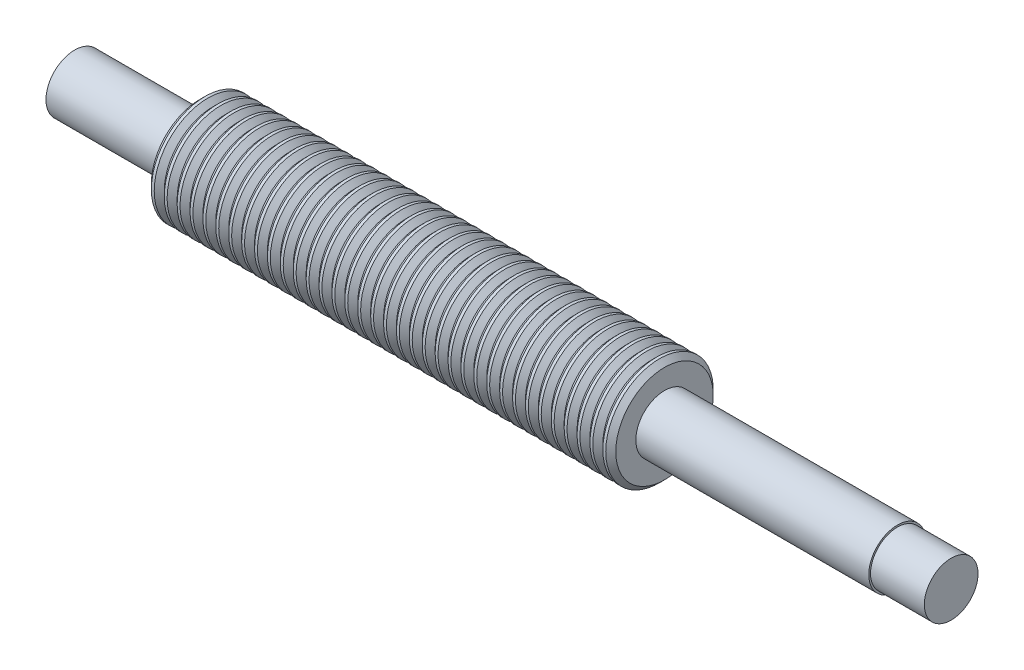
ISO-10303-21;
HEADER;
FILE_DESCRIPTION(('STEP AP214'),'2;1');
FILE_NAME('part.step','',(''),(''),'','','');
FILE_SCHEMA(('AUTOMOTIVE_DESIGN { 1 0 10303 214 1 1 1 1 }'));
ENDSEC;
DATA;
#1=APPLICATION_CONTEXT('core data for automotive mechanical design processes');
#2=APPLICATION_PROTOCOL_DEFINITION('international standard','automotive_design',2000,#1);
#3=PRODUCT_CONTEXT('',#1,'mechanical');
#4=PRODUCT('Part','Part','',(#3));
#5=PRODUCT_RELATED_PRODUCT_CATEGORY('part','',(#4));
#6=PRODUCT_DEFINITION_FORMATION('','',#4);
#7=PRODUCT_DEFINITION_CONTEXT('part definition',#1,'design');
#8=PRODUCT_DEFINITION('design','',#6,#7);
#9=PRODUCT_DEFINITION_SHAPE('','',#8);
#10=(LENGTH_UNIT() NAMED_UNIT(*) SI_UNIT(.MILLI.,.METRE.));
#11=(NAMED_UNIT(*) PLANE_ANGLE_UNIT() SI_UNIT($,.RADIAN.));
#12=(NAMED_UNIT(*) SI_UNIT($,.STERADIAN.) SOLID_ANGLE_UNIT());
#13=UNCERTAINTY_MEASURE_WITH_UNIT(LENGTH_MEASURE(1.E-05),#10,'distance_accuracy_value','');
#14=(GEOMETRIC_REPRESENTATION_CONTEXT(3) GLOBAL_UNCERTAINTY_ASSIGNED_CONTEXT((#13)) GLOBAL_UNIT_ASSIGNED_CONTEXT((#10,
#11,#12)) REPRESENTATION_CONTEXT('',''));
#15=CARTESIAN_POINT('',(0.,0.,0.));
#16=DIRECTION('',(0.,0.,1.));
#17=DIRECTION('',(1.,0.,0.));
#18=AXIS2_PLACEMENT_3D('',#15,#16,#17);
#19=CARTESIAN_POINT('',(0.,0.,0.));
#20=DIRECTION('',(1.,0.,0.));
#21=DIRECTION('',(0.,0.,-1.));
#22=AXIS2_PLACEMENT_3D('',#19,#20,#21);
#23=PLANE('',#22);
#24=CARTESIAN_POINT('',(0.,0.,0.));
#25=DIRECTION('',(-1.,0.,0.));
#26=DIRECTION('',(0.,0.,1.));
#27=AXIS2_PLACEMENT_3D('',#24,#25,#26);
#28=CIRCLE('',#27,39.9999999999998);
#29=CARTESIAN_POINT('',(0.,0.,39.9999999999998));
#30=VERTEX_POINT('',#29);
#31=EDGE_CURVE('E12',#30,#30,#28,.T.);
#32=ORIENTED_EDGE('',*,*,#31,.T.);
#33=EDGE_LOOP('',(#32));
#34=FACE_BOUND('',#33,.T.);
#35=ADVANCED_FACE('F47',(#34),#23,.F.);
#36=CARTESIAN_POINT('',(0.,0.,0.));
#37=DIRECTION('',(-1.,0.,0.));
#38=DIRECTION('',(0.,0.,1.));
#39=AXIS2_PLACEMENT_3D('',#36,#37,#38);
#40=CYLINDRICAL_SURFACE('',#39,39.9999999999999);
#41=ORIENTED_EDGE('',*,*,#31,.F.);
#42=EDGE_LOOP('',(#41));
#43=FACE_BOUND('',#42,.T.);
#44=CARTESIAN_POINT('',(175.,0.,0.));
#45=DIRECTION('',(-1.,0.,0.));
#46=DIRECTION('',(0.,0.,1.));
#47=AXIS2_PLACEMENT_3D('',#44,#45,#46);
#48=CIRCLE('',#47,39.9999999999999);
#49=CARTESIAN_POINT('',(175.,0.,39.9999999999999));
#50=VERTEX_POINT('',#49);
#51=EDGE_CURVE('E53',#50,#50,#48,.T.);
#52=ORIENTED_EDGE('',*,*,#51,.T.);
#53=EDGE_LOOP('',(#52));
#54=FACE_BOUND('',#53,.T.);
#55=ADVANCED_FACE('F412',(#43,#54),#40,.T.);
#56=CARTESIAN_POINT('',(175.,39.9999999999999,0.));
#57=DIRECTION('',(1.,0.,0.));
#58=DIRECTION('',(0.,0.,-1.));
#59=AXIS2_PLACEMENT_3D('',#56,#57,#58);
#60=PLANE('',#59);
#61=ORIENTED_EDGE('',*,*,#51,.F.);
#62=EDGE_LOOP('',(#61));
#63=FACE_BOUND('',#62,.T.);
#64=CARTESIAN_POINT('',(175.,0.,0.));
#65=DIRECTION('',(-1.,0.,0.));
#66=DIRECTION('',(0.,0.,1.));
#67=AXIS2_PLACEMENT_3D('',#64,#65,#66);
#68=CIRCLE('',#67,68.0000000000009);
#69=CARTESIAN_POINT('',(175.,0.,68.0000000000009));
#70=VERTEX_POINT('',#69);
#71=EDGE_CURVE('E57',#70,#70,#68,.T.);
#72=ORIENTED_EDGE('',*,*,#71,.T.);
#73=EDGE_LOOP('',(#72));
#74=FACE_BOUND('',#73,.T.);
#75=ADVANCED_FACE('F416',(#63,#74),#60,.F.);
#76=CARTESIAN_POINT('',(181.999999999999,0.,0.));
#77=DIRECTION('',(1.,0.,0.));
#78=DIRECTION('',(0.,0.,-1.));
#79=AXIS2_PLACEMENT_3D('',#76,#77,#78);
#80=CONICAL_SURFACE('',#79,74.9999999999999,0.785398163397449);
#81=ORIENTED_EDGE('',*,*,#71,.F.);
#82=EDGE_LOOP('',(#81));
#83=FACE_BOUND('',#82,.T.);
#84=CARTESIAN_POINT('',(181.999999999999,0.,0.));
#85=DIRECTION('',(-1.,0.,0.));
#86=DIRECTION('',(0.,0.,1.));
#87=AXIS2_PLACEMENT_3D('',#84,#85,#86);
#88=CIRCLE('',#87,74.9999999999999);
#89=CARTESIAN_POINT('',(181.999999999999,0.,74.9999999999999));
#90=VERTEX_POINT('',#89);
#91=EDGE_CURVE('E61',#90,#90,#88,.T.);
#92=ORIENTED_EDGE('',*,*,#91,.T.);
#93=EDGE_LOOP('',(#92));
#94=FACE_BOUND('',#93,.T.);
#95=ADVANCED_FACE('F421',(#83,#94),#80,.T.);
#96=CARTESIAN_POINT('',(0.,0.,0.));
#97=DIRECTION('',(-1.,0.,0.));
#98=DIRECTION('',(0.,0.,1.));
#99=AXIS2_PLACEMENT_3D('',#96,#97,#98);
#100=CYLINDRICAL_SURFACE('',#99,74.9999999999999);
#101=ORIENTED_EDGE('',*,*,#91,.F.);
#102=EDGE_LOOP('',(#101));
#103=FACE_BOUND('',#102,.T.);
#104=CARTESIAN_POINT('',(186.000000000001,0.,0.));
#105=DIRECTION('',(-1.,0.,0.));
#106=DIRECTION('',(0.,0.,1.));
#107=AXIS2_PLACEMENT_3D('',#104,#105,#106);
#108=CIRCLE('',#107,74.9999999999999);
#109=CARTESIAN_POINT('',(186.000000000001,0.,74.9999999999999));
#110=VERTEX_POINT('',#109);
#111=EDGE_CURVE('E66',#110,#110,#108,.T.);
#112=ORIENTED_EDGE('',*,*,#111,.T.);
#113=EDGE_LOOP('',(#112));
#114=FACE_BOUND('',#113,.T.);
#115=ADVANCED_FACE('F427',(#103,#114),#100,.T.);
#116=CARTESIAN_POINT('',(193.,0.,0.));
#117=DIRECTION('',(-1.,0.,0.));
#118=DIRECTION('',(0.,0.,1.));
#119=AXIS2_PLACEMENT_3D('',#116,#117,#118);
#120=CONICAL_SURFACE('',#119,68.0000000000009,0.78539816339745);
#121=ORIENTED_EDGE('',*,*,#111,.F.);
#122=EDGE_LOOP('',(#121));
#123=FACE_BOUND('',#122,.T.);
#124=CARTESIAN_POINT('',(193.,0.,0.));
#125=DIRECTION('',(-1.,0.,0.));
#126=DIRECTION('',(0.,0.,1.));
#127=AXIS2_PLACEMENT_3D('',#124,#125,#126);
#128=CIRCLE('',#127,68.0000000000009);
#129=CARTESIAN_POINT('',(193.,0.,68.0000000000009));
#130=VERTEX_POINT('',#129);
#131=EDGE_CURVE('E69',#130,#130,#128,.T.);
#132=ORIENTED_EDGE('',*,*,#131,.T.);
#133=EDGE_LOOP('',(#132));
#134=FACE_BOUND('',#133,.T.);
#135=ADVANCED_FACE('F431',(#123,#134),#120,.T.);
#136=CARTESIAN_POINT('',(199.999999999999,0.,0.));
#137=DIRECTION('',(1.,0.,0.));
#138=DIRECTION('',(0.,0.,-1.));
#139=AXIS2_PLACEMENT_3D('',#136,#137,#138);
#140=CONICAL_SURFACE('',#139,74.9999999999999,0.785398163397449);
#141=ORIENTED_EDGE('',*,*,#131,.F.);
#142=EDGE_LOOP('',(#141));
#143=FACE_BOUND('',#142,.T.);
#144=CARTESIAN_POINT('',(199.999999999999,0.,0.));
#145=DIRECTION('',(-1.,0.,0.));
#146=DIRECTION('',(0.,0.,1.));
#147=AXIS2_PLACEMENT_3D('',#144,#145,#146);
#148=CIRCLE('',#147,74.9999999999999);
#149=CARTESIAN_POINT('',(199.999999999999,0.,74.9999999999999));
#150=VERTEX_POINT('',#149);
#151=EDGE_CURVE('E72',#150,#150,#148,.T.);
#152=ORIENTED_EDGE('',*,*,#151,.T.);
#153=EDGE_LOOP('',(#152));
#154=FACE_BOUND('',#153,.T.);
#155=ADVANCED_FACE('F435',(#143,#154),#140,.T.);
#156=CARTESIAN_POINT('',(0.,0.,0.));
#157=DIRECTION('',(-1.,0.,0.));
#158=DIRECTION('',(0.,0.,1.));
#159=AXIS2_PLACEMENT_3D('',#156,#157,#158);
#160=CYLINDRICAL_SURFACE('',#159,74.9999999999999);
#161=ORIENTED_EDGE('',*,*,#151,.F.);
#162=EDGE_LOOP('',(#161));
#163=FACE_BOUND('',#162,.T.);
#164=CARTESIAN_POINT('',(204.000000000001,0.,0.));
#165=DIRECTION('',(-1.,0.,0.));
#166=DIRECTION('',(0.,0.,1.));
#167=AXIS2_PLACEMENT_3D('',#164,#165,#166);
#168=CIRCLE('',#167,74.9999999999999);
#169=CARTESIAN_POINT('',(204.000000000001,0.,74.9999999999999));
#170=VERTEX_POINT('',#169);
#171=EDGE_CURVE('E75',#170,#170,#168,.T.);
#172=ORIENTED_EDGE('',*,*,#171,.T.);
#173=EDGE_LOOP('',(#172));
#174=FACE_BOUND('',#173,.T.);
#175=ADVANCED_FACE('F439',(#163,#174),#160,.T.);
#176=CARTESIAN_POINT('',(211.,0.,0.));
#177=DIRECTION('',(-1.,0.,0.));
#178=DIRECTION('',(0.,0.,1.));
#179=AXIS2_PLACEMENT_3D('',#176,#177,#178);
#180=CONICAL_SURFACE('',#179,68.0000000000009,0.78539816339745);
#181=ORIENTED_EDGE('',*,*,#171,.F.);
#182=EDGE_LOOP('',(#181));
#183=FACE_BOUND('',#182,.T.);
#184=CARTESIAN_POINT('',(211.,0.,0.));
#185=DIRECTION('',(-1.,0.,0.));
#186=DIRECTION('',(0.,0.,1.));
#187=AXIS2_PLACEMENT_3D('',#184,#185,#186);
#188=CIRCLE('',#187,68.0000000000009);
#189=CARTESIAN_POINT('',(211.,0.,68.0000000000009));
#190=VERTEX_POINT('',#189);
#191=EDGE_CURVE('E78',#190,#190,#188,.T.);
#192=ORIENTED_EDGE('',*,*,#191,.T.);
#193=EDGE_LOOP('',(#192));
#194=FACE_BOUND('',#193,.T.);
#195=ADVANCED_FACE('F443',(#183,#194),#180,.T.);
#196=CARTESIAN_POINT('',(217.999999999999,0.,0.));
#197=DIRECTION('',(1.,0.,0.));
#198=DIRECTION('',(0.,0.,-1.));
#199=AXIS2_PLACEMENT_3D('',#196,#197,#198);
#200=CONICAL_SURFACE('',#199,74.9999999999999,0.785398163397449);
#201=ORIENTED_EDGE('',*,*,#191,.F.);
#202=EDGE_LOOP('',(#201));
#203=FACE_BOUND('',#202,.T.);
#204=CARTESIAN_POINT('',(217.999999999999,0.,0.));
#205=DIRECTION('',(-1.,0.,0.));
#206=DIRECTION('',(0.,0.,1.));
#207=AXIS2_PLACEMENT_3D('',#204,#205,#206);
#208=CIRCLE('',#207,74.9999999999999);
#209=CARTESIAN_POINT('',(217.999999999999,0.,74.9999999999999));
#210=VERTEX_POINT('',#209);
#211=EDGE_CURVE('E81',#210,#210,#208,.T.);
#212=ORIENTED_EDGE('',*,*,#211,.T.);
#213=EDGE_LOOP('',(#212));
#214=FACE_BOUND('',#213,.T.);
#215=ADVANCED_FACE('F447',(#203,#214),#200,.T.);
#216=CARTESIAN_POINT('',(0.,0.,0.));
#217=DIRECTION('',(-1.,0.,0.));
#218=DIRECTION('',(0.,0.,1.));
#219=AXIS2_PLACEMENT_3D('',#216,#217,#218);
#220=CYLINDRICAL_SURFACE('',#219,74.9999999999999);
#221=ORIENTED_EDGE('',*,*,#211,.F.);
#222=EDGE_LOOP('',(#221));
#223=FACE_BOUND('',#222,.T.);
#224=CARTESIAN_POINT('',(222.000000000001,0.,0.));
#225=DIRECTION('',(-1.,0.,0.));
#226=DIRECTION('',(0.,0.,1.));
#227=AXIS2_PLACEMENT_3D('',#224,#225,#226);
#228=CIRCLE('',#227,74.9999999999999);
#229=CARTESIAN_POINT('',(222.000000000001,0.,74.9999999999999));
#230=VERTEX_POINT('',#229);
#231=EDGE_CURVE('E84',#230,#230,#228,.T.);
#232=ORIENTED_EDGE('',*,*,#231,.T.);
#233=EDGE_LOOP('',(#232));
#234=FACE_BOUND('',#233,.T.);
#235=ADVANCED_FACE('F451',(#223,#234),#220,.T.);
#236=CARTESIAN_POINT('',(229.,0.,0.));
#237=DIRECTION('',(-1.,0.,0.));
#238=DIRECTION('',(0.,0.,1.));
#239=AXIS2_PLACEMENT_3D('',#236,#237,#238);
#240=CONICAL_SURFACE('',#239,68.0000000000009,0.78539816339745);
#241=ORIENTED_EDGE('',*,*,#231,.F.);
#242=EDGE_LOOP('',(#241));
#243=FACE_BOUND('',#242,.T.);
#244=CARTESIAN_POINT('',(229.,0.,0.));
#245=DIRECTION('',(-1.,0.,0.));
#246=DIRECTION('',(0.,0.,1.));
#247=AXIS2_PLACEMENT_3D('',#244,#245,#246);
#248=CIRCLE('',#247,68.0000000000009);
#249=CARTESIAN_POINT('',(229.,0.,68.0000000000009));
#250=VERTEX_POINT('',#249);
#251=EDGE_CURVE('E87',#250,#250,#248,.T.);
#252=ORIENTED_EDGE('',*,*,#251,.T.);
#253=EDGE_LOOP('',(#252));
#254=FACE_BOUND('',#253,.T.);
#255=ADVANCED_FACE('F455',(#243,#254),#240,.T.);
#256=CARTESIAN_POINT('',(235.999999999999,0.,0.));
#257=DIRECTION('',(1.,0.,0.));
#258=DIRECTION('',(0.,0.,-1.));
#259=AXIS2_PLACEMENT_3D('',#256,#257,#258);
#260=CONICAL_SURFACE('',#259,74.9999999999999,0.785398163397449);
#261=ORIENTED_EDGE('',*,*,#251,.F.);
#262=EDGE_LOOP('',(#261));
#263=FACE_BOUND('',#262,.T.);
#264=CARTESIAN_POINT('',(235.999999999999,0.,0.));
#265=DIRECTION('',(-1.,0.,0.));
#266=DIRECTION('',(0.,0.,1.));
#267=AXIS2_PLACEMENT_3D('',#264,#265,#266);
#268=CIRCLE('',#267,74.9999999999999);
#269=CARTESIAN_POINT('',(235.999999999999,0.,74.9999999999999));
#270=VERTEX_POINT('',#269);
#271=EDGE_CURVE('E90',#270,#270,#268,.T.);
#272=ORIENTED_EDGE('',*,*,#271,.T.);
#273=EDGE_LOOP('',(#272));
#274=FACE_BOUND('',#273,.T.);
#275=ADVANCED_FACE('F459',(#263,#274),#260,.T.);
#276=CARTESIAN_POINT('',(0.,0.,0.));
#277=DIRECTION('',(-1.,0.,0.));
#278=DIRECTION('',(0.,0.,1.));
#279=AXIS2_PLACEMENT_3D('',#276,#277,#278);
#280=CYLINDRICAL_SURFACE('',#279,74.9999999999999);
#281=ORIENTED_EDGE('',*,*,#271,.F.);
#282=EDGE_LOOP('',(#281));
#283=FACE_BOUND('',#282,.T.);
#284=CARTESIAN_POINT('',(240.000000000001,0.,0.));
#285=DIRECTION('',(-1.,0.,0.));
#286=DIRECTION('',(0.,0.,1.));
#287=AXIS2_PLACEMENT_3D('',#284,#285,#286);
#288=CIRCLE('',#287,74.9999999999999);
#289=CARTESIAN_POINT('',(240.000000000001,0.,74.9999999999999));
#290=VERTEX_POINT('',#289);
#291=EDGE_CURVE('E93',#290,#290,#288,.T.);
#292=ORIENTED_EDGE('',*,*,#291,.T.);
#293=EDGE_LOOP('',(#292));
#294=FACE_BOUND('',#293,.T.);
#295=ADVANCED_FACE('F463',(#283,#294),#280,.T.);
#296=CARTESIAN_POINT('',(247.,0.,0.));
#297=DIRECTION('',(-1.,0.,0.));
#298=DIRECTION('',(0.,0.,1.));
#299=AXIS2_PLACEMENT_3D('',#296,#297,#298);
#300=CONICAL_SURFACE('',#299,68.0000000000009,0.78539816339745);
#301=ORIENTED_EDGE('',*,*,#291,.F.);
#302=EDGE_LOOP('',(#301));
#303=FACE_BOUND('',#302,.T.);
#304=CARTESIAN_POINT('',(247.,0.,0.));
#305=DIRECTION('',(-1.,0.,0.));
#306=DIRECTION('',(0.,0.,1.));
#307=AXIS2_PLACEMENT_3D('',#304,#305,#306);
#308=CIRCLE('',#307,68.0000000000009);
#309=CARTESIAN_POINT('',(247.,0.,68.0000000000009));
#310=VERTEX_POINT('',#309);
#311=EDGE_CURVE('E96',#310,#310,#308,.T.);
#312=ORIENTED_EDGE('',*,*,#311,.T.);
#313=EDGE_LOOP('',(#312));
#314=FACE_BOUND('',#313,.T.);
#315=ADVANCED_FACE('F467',(#303,#314),#300,.T.);
#316=CARTESIAN_POINT('',(253.999999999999,0.,0.));
#317=DIRECTION('',(1.,0.,0.));
#318=DIRECTION('',(0.,0.,-1.));
#319=AXIS2_PLACEMENT_3D('',#316,#317,#318);
#320=CONICAL_SURFACE('',#319,74.9999999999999,0.785398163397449);
#321=ORIENTED_EDGE('',*,*,#311,.F.);
#322=EDGE_LOOP('',(#321));
#323=FACE_BOUND('',#322,.T.);
#324=CARTESIAN_POINT('',(253.999999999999,0.,0.));
#325=DIRECTION('',(-1.,0.,0.));
#326=DIRECTION('',(0.,0.,1.));
#327=AXIS2_PLACEMENT_3D('',#324,#325,#326);
#328=CIRCLE('',#327,74.9999999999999);
#329=CARTESIAN_POINT('',(253.999999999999,0.,74.9999999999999));
#330=VERTEX_POINT('',#329);
#331=EDGE_CURVE('E99',#330,#330,#328,.T.);
#332=ORIENTED_EDGE('',*,*,#331,.T.);
#333=EDGE_LOOP('',(#332));
#334=FACE_BOUND('',#333,.T.);
#335=ADVANCED_FACE('F471',(#323,#334),#320,.T.);
#336=CARTESIAN_POINT('',(0.,0.,0.));
#337=DIRECTION('',(-1.,0.,0.));
#338=DIRECTION('',(0.,0.,1.));
#339=AXIS2_PLACEMENT_3D('',#336,#337,#338);
#340=CYLINDRICAL_SURFACE('',#339,74.9999999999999);
#341=ORIENTED_EDGE('',*,*,#331,.F.);
#342=EDGE_LOOP('',(#341));
#343=FACE_BOUND('',#342,.T.);
#344=CARTESIAN_POINT('',(258.000000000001,0.,0.));
#345=DIRECTION('',(-1.,0.,0.));
#346=DIRECTION('',(0.,0.,1.));
#347=AXIS2_PLACEMENT_3D('',#344,#345,#346);
#348=CIRCLE('',#347,74.9999999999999);
#349=CARTESIAN_POINT('',(258.000000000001,0.,74.9999999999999));
#350=VERTEX_POINT('',#349);
#351=EDGE_CURVE('E102',#350,#350,#348,.T.);
#352=ORIENTED_EDGE('',*,*,#351,.T.);
#353=EDGE_LOOP('',(#352));
#354=FACE_BOUND('',#353,.T.);
#355=ADVANCED_FACE('F475',(#343,#354),#340,.T.);
#356=CARTESIAN_POINT('',(265.,0.,0.));
#357=DIRECTION('',(-1.,0.,0.));
#358=DIRECTION('',(0.,0.,1.));
#359=AXIS2_PLACEMENT_3D('',#356,#357,#358);
#360=CONICAL_SURFACE('',#359,68.0000000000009,0.78539816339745);
#361=ORIENTED_EDGE('',*,*,#351,.F.);
#362=EDGE_LOOP('',(#361));
#363=FACE_BOUND('',#362,.T.);
#364=CARTESIAN_POINT('',(265.,0.,0.));
#365=DIRECTION('',(-1.,0.,0.));
#366=DIRECTION('',(0.,0.,1.));
#367=AXIS2_PLACEMENT_3D('',#364,#365,#366);
#368=CIRCLE('',#367,68.0000000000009);
#369=CARTESIAN_POINT('',(265.,0.,68.0000000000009));
#370=VERTEX_POINT('',#369);
#371=EDGE_CURVE('E105',#370,#370,#368,.T.);
#372=ORIENTED_EDGE('',*,*,#371,.T.);
#373=EDGE_LOOP('',(#372));
#374=FACE_BOUND('',#373,.T.);
#375=ADVANCED_FACE('F479',(#363,#374),#360,.T.);
#376=CARTESIAN_POINT('',(271.999999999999,0.,0.));
#377=DIRECTION('',(1.,0.,0.));
#378=DIRECTION('',(0.,0.,-1.));
#379=AXIS2_PLACEMENT_3D('',#376,#377,#378);
#380=CONICAL_SURFACE('',#379,74.9999999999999,0.785398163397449);
#381=ORIENTED_EDGE('',*,*,#371,.F.);
#382=EDGE_LOOP('',(#381));
#383=FACE_BOUND('',#382,.T.);
#384=CARTESIAN_POINT('',(271.999999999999,0.,0.));
#385=DIRECTION('',(-1.,0.,0.));
#386=DIRECTION('',(0.,0.,1.));
#387=AXIS2_PLACEMENT_3D('',#384,#385,#386);
#388=CIRCLE('',#387,74.9999999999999);
#389=CARTESIAN_POINT('',(271.999999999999,0.,74.9999999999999));
#390=VERTEX_POINT('',#389);
#391=EDGE_CURVE('E108',#390,#390,#388,.T.);
#392=ORIENTED_EDGE('',*,*,#391,.T.);
#393=EDGE_LOOP('',(#392));
#394=FACE_BOUND('',#393,.T.);
#395=ADVANCED_FACE('F483',(#383,#394),#380,.T.);
#396=CARTESIAN_POINT('',(0.,0.,0.));
#397=DIRECTION('',(-1.,0.,0.));
#398=DIRECTION('',(0.,0.,1.));
#399=AXIS2_PLACEMENT_3D('',#396,#397,#398);
#400=CYLINDRICAL_SURFACE('',#399,74.9999999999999);
#401=ORIENTED_EDGE('',*,*,#391,.F.);
#402=EDGE_LOOP('',(#401));
#403=FACE_BOUND('',#402,.T.);
#404=CARTESIAN_POINT('',(276.000000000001,0.,0.));
#405=DIRECTION('',(-1.,0.,0.));
#406=DIRECTION('',(0.,0.,1.));
#407=AXIS2_PLACEMENT_3D('',#404,#405,#406);
#408=CIRCLE('',#407,74.9999999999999);
#409=CARTESIAN_POINT('',(276.000000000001,0.,74.9999999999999));
#410=VERTEX_POINT('',#409);
#411=EDGE_CURVE('E111',#410,#410,#408,.T.);
#412=ORIENTED_EDGE('',*,*,#411,.T.);
#413=EDGE_LOOP('',(#412));
#414=FACE_BOUND('',#413,.T.);
#415=ADVANCED_FACE('F487',(#403,#414),#400,.T.);
#416=CARTESIAN_POINT('',(283.,0.,0.));
#417=DIRECTION('',(-1.,0.,0.));
#418=DIRECTION('',(0.,0.,1.));
#419=AXIS2_PLACEMENT_3D('',#416,#417,#418);
#420=CONICAL_SURFACE('',#419,68.0000000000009,0.78539816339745);
#421=ORIENTED_EDGE('',*,*,#411,.F.);
#422=EDGE_LOOP('',(#421));
#423=FACE_BOUND('',#422,.T.);
#424=CARTESIAN_POINT('',(283.,0.,0.));
#425=DIRECTION('',(-1.,0.,0.));
#426=DIRECTION('',(0.,0.,1.));
#427=AXIS2_PLACEMENT_3D('',#424,#425,#426);
#428=CIRCLE('',#427,68.0000000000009);
#429=CARTESIAN_POINT('',(283.,0.,68.0000000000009));
#430=VERTEX_POINT('',#429);
#431=EDGE_CURVE('E114',#430,#430,#428,.T.);
#432=ORIENTED_EDGE('',*,*,#431,.T.);
#433=EDGE_LOOP('',(#432));
#434=FACE_BOUND('',#433,.T.);
#435=ADVANCED_FACE('F491',(#423,#434),#420,.T.);
#436=CARTESIAN_POINT('',(289.999999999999,0.,0.));
#437=DIRECTION('',(1.,0.,0.));
#438=DIRECTION('',(0.,0.,-1.));
#439=AXIS2_PLACEMENT_3D('',#436,#437,#438);
#440=CONICAL_SURFACE('',#439,74.9999999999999,0.785398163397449);
#441=ORIENTED_EDGE('',*,*,#431,.F.);
#442=EDGE_LOOP('',(#441));
#443=FACE_BOUND('',#442,.T.);
#444=CARTESIAN_POINT('',(289.999999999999,0.,0.));
#445=DIRECTION('',(-1.,0.,0.));
#446=DIRECTION('',(0.,0.,1.));
#447=AXIS2_PLACEMENT_3D('',#444,#445,#446);
#448=CIRCLE('',#447,74.9999999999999);
#449=CARTESIAN_POINT('',(289.999999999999,0.,74.9999999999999));
#450=VERTEX_POINT('',#449);
#451=EDGE_CURVE('E117',#450,#450,#448,.T.);
#452=ORIENTED_EDGE('',*,*,#451,.T.);
#453=EDGE_LOOP('',(#452));
#454=FACE_BOUND('',#453,.T.);
#455=ADVANCED_FACE('F495',(#443,#454),#440,.T.);
#456=CARTESIAN_POINT('',(0.,0.,0.));
#457=DIRECTION('',(-1.,0.,0.));
#458=DIRECTION('',(0.,0.,1.));
#459=AXIS2_PLACEMENT_3D('',#456,#457,#458);
#460=CYLINDRICAL_SURFACE('',#459,74.9999999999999);
#461=ORIENTED_EDGE('',*,*,#451,.F.);
#462=EDGE_LOOP('',(#461));
#463=FACE_BOUND('',#462,.T.);
#464=CARTESIAN_POINT('',(294.000000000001,0.,0.));
#465=DIRECTION('',(-1.,0.,0.));
#466=DIRECTION('',(0.,0.,1.));
#467=AXIS2_PLACEMENT_3D('',#464,#465,#466);
#468=CIRCLE('',#467,74.9999999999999);
#469=CARTESIAN_POINT('',(294.000000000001,0.,74.9999999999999));
#470=VERTEX_POINT('',#469);
#471=EDGE_CURVE('E120',#470,#470,#468,.T.);
#472=ORIENTED_EDGE('',*,*,#471,.T.);
#473=EDGE_LOOP('',(#472));
#474=FACE_BOUND('',#473,.T.);
#475=ADVANCED_FACE('F499',(#463,#474),#460,.T.);
#476=CARTESIAN_POINT('',(301.,0.,0.));
#477=DIRECTION('',(-1.,0.,0.));
#478=DIRECTION('',(0.,0.,1.));
#479=AXIS2_PLACEMENT_3D('',#476,#477,#478);
#480=CONICAL_SURFACE('',#479,68.0000000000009,0.78539816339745);
#481=ORIENTED_EDGE('',*,*,#471,.F.);
#482=EDGE_LOOP('',(#481));
#483=FACE_BOUND('',#482,.T.);
#484=CARTESIAN_POINT('',(301.,0.,0.));
#485=DIRECTION('',(-1.,0.,0.));
#486=DIRECTION('',(0.,0.,1.));
#487=AXIS2_PLACEMENT_3D('',#484,#485,#486);
#488=CIRCLE('',#487,68.0000000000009);
#489=CARTESIAN_POINT('',(301.,0.,68.0000000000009));
#490=VERTEX_POINT('',#489);
#491=EDGE_CURVE('E123',#490,#490,#488,.T.);
#492=ORIENTED_EDGE('',*,*,#491,.T.);
#493=EDGE_LOOP('',(#492));
#494=FACE_BOUND('',#493,.T.);
#495=ADVANCED_FACE('F503',(#483,#494),#480,.T.);
#496=CARTESIAN_POINT('',(307.999999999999,0.,0.));
#497=DIRECTION('',(1.,0.,0.));
#498=DIRECTION('',(0.,0.,-1.));
#499=AXIS2_PLACEMENT_3D('',#496,#497,#498);
#500=CONICAL_SURFACE('',#499,74.9999999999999,0.785398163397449);
#501=ORIENTED_EDGE('',*,*,#491,.F.);
#502=EDGE_LOOP('',(#501));
#503=FACE_BOUND('',#502,.T.);
#504=CARTESIAN_POINT('',(307.999999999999,0.,0.));
#505=DIRECTION('',(-1.,0.,0.));
#506=DIRECTION('',(0.,0.,1.));
#507=AXIS2_PLACEMENT_3D('',#504,#505,#506);
#508=CIRCLE('',#507,74.9999999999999);
#509=CARTESIAN_POINT('',(307.999999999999,0.,74.9999999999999));
#510=VERTEX_POINT('',#509);
#511=EDGE_CURVE('E126',#510,#510,#508,.T.);
#512=ORIENTED_EDGE('',*,*,#511,.T.);
#513=EDGE_LOOP('',(#512));
#514=FACE_BOUND('',#513,.T.);
#515=ADVANCED_FACE('F507',(#503,#514),#500,.T.);
#516=CARTESIAN_POINT('',(0.,0.,0.));
#517=DIRECTION('',(-1.,0.,0.));
#518=DIRECTION('',(0.,0.,1.));
#519=AXIS2_PLACEMENT_3D('',#516,#517,#518);
#520=CYLINDRICAL_SURFACE('',#519,74.9999999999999);
#521=ORIENTED_EDGE('',*,*,#511,.F.);
#522=EDGE_LOOP('',(#521));
#523=FACE_BOUND('',#522,.T.);
#524=CARTESIAN_POINT('',(312.000000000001,0.,0.));
#525=DIRECTION('',(-1.,0.,0.));
#526=DIRECTION('',(0.,0.,1.));
#527=AXIS2_PLACEMENT_3D('',#524,#525,#526);
#528=CIRCLE('',#527,74.9999999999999);
#529=CARTESIAN_POINT('',(312.000000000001,0.,74.9999999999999));
#530=VERTEX_POINT('',#529);
#531=EDGE_CURVE('E129',#530,#530,#528,.T.);
#532=ORIENTED_EDGE('',*,*,#531,.T.);
#533=EDGE_LOOP('',(#532));
#534=FACE_BOUND('',#533,.T.);
#535=ADVANCED_FACE('F511',(#523,#534),#520,.T.);
#536=CARTESIAN_POINT('',(319.,0.,0.));
#537=DIRECTION('',(-1.,0.,0.));
#538=DIRECTION('',(0.,0.,1.));
#539=AXIS2_PLACEMENT_3D('',#536,#537,#538);
#540=CONICAL_SURFACE('',#539,68.0000000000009,0.78539816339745);
#541=ORIENTED_EDGE('',*,*,#531,.F.);
#542=EDGE_LOOP('',(#541));
#543=FACE_BOUND('',#542,.T.);
#544=CARTESIAN_POINT('',(319.,0.,0.));
#545=DIRECTION('',(-1.,0.,0.));
#546=DIRECTION('',(0.,0.,1.));
#547=AXIS2_PLACEMENT_3D('',#544,#545,#546);
#548=CIRCLE('',#547,68.0000000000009);
#549=CARTESIAN_POINT('',(319.,0.,68.0000000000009));
#550=VERTEX_POINT('',#549);
#551=EDGE_CURVE('E132',#550,#550,#548,.T.);
#552=ORIENTED_EDGE('',*,*,#551,.T.);
#553=EDGE_LOOP('',(#552));
#554=FACE_BOUND('',#553,.T.);
#555=ADVANCED_FACE('F515',(#543,#554),#540,.T.);
#556=CARTESIAN_POINT('',(325.999999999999,0.,0.));
#557=DIRECTION('',(1.,0.,0.));
#558=DIRECTION('',(0.,0.,-1.));
#559=AXIS2_PLACEMENT_3D('',#556,#557,#558);
#560=CONICAL_SURFACE('',#559,74.9999999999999,0.785398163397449);
#561=ORIENTED_EDGE('',*,*,#551,.F.);
#562=EDGE_LOOP('',(#561));
#563=FACE_BOUND('',#562,.T.);
#564=CARTESIAN_POINT('',(325.999999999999,0.,0.));
#565=DIRECTION('',(-1.,0.,0.));
#566=DIRECTION('',(0.,0.,1.));
#567=AXIS2_PLACEMENT_3D('',#564,#565,#566);
#568=CIRCLE('',#567,74.9999999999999);
#569=CARTESIAN_POINT('',(325.999999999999,0.,74.9999999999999));
#570=VERTEX_POINT('',#569);
#571=EDGE_CURVE('E135',#570,#570,#568,.T.);
#572=ORIENTED_EDGE('',*,*,#571,.T.);
#573=EDGE_LOOP('',(#572));
#574=FACE_BOUND('',#573,.T.);
#575=ADVANCED_FACE('F519',(#563,#574),#560,.T.);
#576=CARTESIAN_POINT('',(0.,0.,0.));
#577=DIRECTION('',(-1.,0.,0.));
#578=DIRECTION('',(0.,0.,1.));
#579=AXIS2_PLACEMENT_3D('',#576,#577,#578);
#580=CYLINDRICAL_SURFACE('',#579,74.9999999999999);
#581=ORIENTED_EDGE('',*,*,#571,.F.);
#582=EDGE_LOOP('',(#581));
#583=FACE_BOUND('',#582,.T.);
#584=CARTESIAN_POINT('',(330.000000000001,0.,0.));
#585=DIRECTION('',(-1.,0.,0.));
#586=DIRECTION('',(0.,0.,1.));
#587=AXIS2_PLACEMENT_3D('',#584,#585,#586);
#588=CIRCLE('',#587,74.9999999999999);
#589=CARTESIAN_POINT('',(330.000000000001,0.,74.9999999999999));
#590=VERTEX_POINT('',#589);
#591=EDGE_CURVE('E138',#590,#590,#588,.T.);
#592=ORIENTED_EDGE('',*,*,#591,.T.);
#593=EDGE_LOOP('',(#592));
#594=FACE_BOUND('',#593,.T.);
#595=ADVANCED_FACE('F523',(#583,#594),#580,.T.);
#596=CARTESIAN_POINT('',(337.,0.,0.));
#597=DIRECTION('',(-1.,0.,0.));
#598=DIRECTION('',(0.,0.,1.));
#599=AXIS2_PLACEMENT_3D('',#596,#597,#598);
#600=CONICAL_SURFACE('',#599,68.0000000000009,0.78539816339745);
#601=ORIENTED_EDGE('',*,*,#591,.F.);
#602=EDGE_LOOP('',(#601));
#603=FACE_BOUND('',#602,.T.);
#604=CARTESIAN_POINT('',(337.,0.,0.));
#605=DIRECTION('',(-1.,0.,0.));
#606=DIRECTION('',(0.,0.,1.));
#607=AXIS2_PLACEMENT_3D('',#604,#605,#606);
#608=CIRCLE('',#607,68.0000000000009);
#609=CARTESIAN_POINT('',(337.,0.,68.0000000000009));
#610=VERTEX_POINT('',#609);
#611=EDGE_CURVE('E141',#610,#610,#608,.T.);
#612=ORIENTED_EDGE('',*,*,#611,.T.);
#613=EDGE_LOOP('',(#612));
#614=FACE_BOUND('',#613,.T.);
#615=ADVANCED_FACE('F527',(#603,#614),#600,.T.);
#616=CARTESIAN_POINT('',(343.999999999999,0.,0.));
#617=DIRECTION('',(1.,0.,0.));
#618=DIRECTION('',(0.,0.,-1.));
#619=AXIS2_PLACEMENT_3D('',#616,#617,#618);
#620=CONICAL_SURFACE('',#619,74.9999999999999,0.785398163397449);
#621=ORIENTED_EDGE('',*,*,#611,.F.);
#622=EDGE_LOOP('',(#621));
#623=FACE_BOUND('',#622,.T.);
#624=CARTESIAN_POINT('',(343.999999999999,0.,0.));
#625=DIRECTION('',(-1.,0.,0.));
#626=DIRECTION('',(0.,0.,1.));
#627=AXIS2_PLACEMENT_3D('',#624,#625,#626);
#628=CIRCLE('',#627,74.9999999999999);
#629=CARTESIAN_POINT('',(343.999999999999,0.,74.9999999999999));
#630=VERTEX_POINT('',#629);
#631=EDGE_CURVE('E144',#630,#630,#628,.T.);
#632=ORIENTED_EDGE('',*,*,#631,.T.);
#633=EDGE_LOOP('',(#632));
#634=FACE_BOUND('',#633,.T.);
#635=ADVANCED_FACE('F531',(#623,#634),#620,.T.);
#636=CARTESIAN_POINT('',(0.,0.,0.));
#637=DIRECTION('',(-1.,0.,0.));
#638=DIRECTION('',(0.,0.,1.));
#639=AXIS2_PLACEMENT_3D('',#636,#637,#638);
#640=CYLINDRICAL_SURFACE('',#639,74.9999999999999);
#641=ORIENTED_EDGE('',*,*,#631,.F.);
#642=EDGE_LOOP('',(#641));
#643=FACE_BOUND('',#642,.T.);
#644=CARTESIAN_POINT('',(348.000000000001,0.,0.));
#645=DIRECTION('',(-1.,0.,0.));
#646=DIRECTION('',(0.,0.,1.));
#647=AXIS2_PLACEMENT_3D('',#644,#645,#646);
#648=CIRCLE('',#647,74.9999999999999);
#649=CARTESIAN_POINT('',(348.000000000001,0.,74.9999999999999));
#650=VERTEX_POINT('',#649);
#651=EDGE_CURVE('E147',#650,#650,#648,.T.);
#652=ORIENTED_EDGE('',*,*,#651,.T.);
#653=EDGE_LOOP('',(#652));
#654=FACE_BOUND('',#653,.T.);
#655=ADVANCED_FACE('F535',(#643,#654),#640,.T.);
#656=CARTESIAN_POINT('',(355.,0.,0.));
#657=DIRECTION('',(-1.,0.,0.));
#658=DIRECTION('',(0.,0.,1.));
#659=AXIS2_PLACEMENT_3D('',#656,#657,#658);
#660=CONICAL_SURFACE('',#659,68.0000000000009,0.78539816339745);
#661=ORIENTED_EDGE('',*,*,#651,.F.);
#662=EDGE_LOOP('',(#661));
#663=FACE_BOUND('',#662,.T.);
#664=CARTESIAN_POINT('',(355.,0.,0.));
#665=DIRECTION('',(-1.,0.,0.));
#666=DIRECTION('',(0.,0.,1.));
#667=AXIS2_PLACEMENT_3D('',#664,#665,#666);
#668=CIRCLE('',#667,68.0000000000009);
#669=CARTESIAN_POINT('',(355.,0.,68.0000000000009));
#670=VERTEX_POINT('',#669);
#671=EDGE_CURVE('E150',#670,#670,#668,.T.);
#672=ORIENTED_EDGE('',*,*,#671,.T.);
#673=EDGE_LOOP('',(#672));
#674=FACE_BOUND('',#673,.T.);
#675=ADVANCED_FACE('F539',(#663,#674),#660,.T.);
#676=CARTESIAN_POINT('',(361.999999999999,0.,0.));
#677=DIRECTION('',(1.,0.,0.));
#678=DIRECTION('',(0.,0.,-1.));
#679=AXIS2_PLACEMENT_3D('',#676,#677,#678);
#680=CONICAL_SURFACE('',#679,74.9999999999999,0.785398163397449);
#681=ORIENTED_EDGE('',*,*,#671,.F.);
#682=EDGE_LOOP('',(#681));
#683=FACE_BOUND('',#682,.T.);
#684=CARTESIAN_POINT('',(361.999999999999,0.,0.));
#685=DIRECTION('',(-1.,0.,0.));
#686=DIRECTION('',(0.,0.,1.));
#687=AXIS2_PLACEMENT_3D('',#684,#685,#686);
#688=CIRCLE('',#687,74.9999999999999);
#689=CARTESIAN_POINT('',(361.999999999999,0.,74.9999999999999));
#690=VERTEX_POINT('',#689);
#691=EDGE_CURVE('E153',#690,#690,#688,.T.);
#692=ORIENTED_EDGE('',*,*,#691,.T.);
#693=EDGE_LOOP('',(#692));
#694=FACE_BOUND('',#693,.T.);
#695=ADVANCED_FACE('F543',(#683,#694),#680,.T.);
#696=CARTESIAN_POINT('',(0.,0.,0.));
#697=DIRECTION('',(-1.,0.,0.));
#698=DIRECTION('',(0.,0.,1.));
#699=AXIS2_PLACEMENT_3D('',#696,#697,#698);
#700=CYLINDRICAL_SURFACE('',#699,74.9999999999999);
#701=ORIENTED_EDGE('',*,*,#691,.F.);
#702=EDGE_LOOP('',(#701));
#703=FACE_BOUND('',#702,.T.);
#704=CARTESIAN_POINT('',(366.000000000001,0.,0.));
#705=DIRECTION('',(-1.,0.,0.));
#706=DIRECTION('',(0.,0.,1.));
#707=AXIS2_PLACEMENT_3D('',#704,#705,#706);
#708=CIRCLE('',#707,74.9999999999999);
#709=CARTESIAN_POINT('',(366.000000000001,0.,74.9999999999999));
#710=VERTEX_POINT('',#709);
#711=EDGE_CURVE('E156',#710,#710,#708,.T.);
#712=ORIENTED_EDGE('',*,*,#711,.T.);
#713=EDGE_LOOP('',(#712));
#714=FACE_BOUND('',#713,.T.);
#715=ADVANCED_FACE('F547',(#703,#714),#700,.T.);
#716=CARTESIAN_POINT('',(373.,0.,0.));
#717=DIRECTION('',(-1.,0.,0.));
#718=DIRECTION('',(0.,0.,1.));
#719=AXIS2_PLACEMENT_3D('',#716,#717,#718);
#720=CONICAL_SURFACE('',#719,68.0000000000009,0.78539816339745);
#721=ORIENTED_EDGE('',*,*,#711,.F.);
#722=EDGE_LOOP('',(#721));
#723=FACE_BOUND('',#722,.T.);
#724=CARTESIAN_POINT('',(373.,0.,0.));
#725=DIRECTION('',(-1.,0.,0.));
#726=DIRECTION('',(0.,0.,1.));
#727=AXIS2_PLACEMENT_3D('',#724,#725,#726);
#728=CIRCLE('',#727,68.0000000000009);
#729=CARTESIAN_POINT('',(373.,0.,68.0000000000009));
#730=VERTEX_POINT('',#729);
#731=EDGE_CURVE('E159',#730,#730,#728,.T.);
#732=ORIENTED_EDGE('',*,*,#731,.T.);
#733=EDGE_LOOP('',(#732));
#734=FACE_BOUND('',#733,.T.);
#735=ADVANCED_FACE('F551',(#723,#734),#720,.T.);
#736=CARTESIAN_POINT('',(379.999999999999,0.,0.));
#737=DIRECTION('',(1.,0.,0.));
#738=DIRECTION('',(0.,0.,-1.));
#739=AXIS2_PLACEMENT_3D('',#736,#737,#738);
#740=CONICAL_SURFACE('',#739,74.9999999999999,0.785398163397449);
#741=ORIENTED_EDGE('',*,*,#731,.F.);
#742=EDGE_LOOP('',(#741));
#743=FACE_BOUND('',#742,.T.);
#744=CARTESIAN_POINT('',(379.999999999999,0.,0.));
#745=DIRECTION('',(-1.,0.,0.));
#746=DIRECTION('',(0.,0.,1.));
#747=AXIS2_PLACEMENT_3D('',#744,#745,#746);
#748=CIRCLE('',#747,74.9999999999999);
#749=CARTESIAN_POINT('',(379.999999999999,0.,74.9999999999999));
#750=VERTEX_POINT('',#749);
#751=EDGE_CURVE('E162',#750,#750,#748,.T.);
#752=ORIENTED_EDGE('',*,*,#751,.T.);
#753=EDGE_LOOP('',(#752));
#754=FACE_BOUND('',#753,.T.);
#755=ADVANCED_FACE('F555',(#743,#754),#740,.T.);
#756=CARTESIAN_POINT('',(0.,0.,0.));
#757=DIRECTION('',(-1.,0.,0.));
#758=DIRECTION('',(0.,0.,1.));
#759=AXIS2_PLACEMENT_3D('',#756,#757,#758);
#760=CYLINDRICAL_SURFACE('',#759,74.9999999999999);
#761=ORIENTED_EDGE('',*,*,#751,.F.);
#762=EDGE_LOOP('',(#761));
#763=FACE_BOUND('',#762,.T.);
#764=CARTESIAN_POINT('',(384.000000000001,0.,0.));
#765=DIRECTION('',(-1.,0.,0.));
#766=DIRECTION('',(0.,0.,1.));
#767=AXIS2_PLACEMENT_3D('',#764,#765,#766);
#768=CIRCLE('',#767,74.9999999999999);
#769=CARTESIAN_POINT('',(384.000000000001,0.,74.9999999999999));
#770=VERTEX_POINT('',#769);
#771=EDGE_CURVE('E165',#770,#770,#768,.T.);
#772=ORIENTED_EDGE('',*,*,#771,.T.);
#773=EDGE_LOOP('',(#772));
#774=FACE_BOUND('',#773,.T.);
#775=ADVANCED_FACE('F559',(#763,#774),#760,.T.);
#776=CARTESIAN_POINT('',(391.,0.,0.));
#777=DIRECTION('',(-1.,0.,0.));
#778=DIRECTION('',(0.,0.,1.));
#779=AXIS2_PLACEMENT_3D('',#776,#777,#778);
#780=CONICAL_SURFACE('',#779,68.0000000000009,0.78539816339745);
#781=ORIENTED_EDGE('',*,*,#771,.F.);
#782=EDGE_LOOP('',(#781));
#783=FACE_BOUND('',#782,.T.);
#784=CARTESIAN_POINT('',(391.,0.,0.));
#785=DIRECTION('',(-1.,0.,0.));
#786=DIRECTION('',(0.,0.,1.));
#787=AXIS2_PLACEMENT_3D('',#784,#785,#786);
#788=CIRCLE('',#787,68.0000000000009);
#789=CARTESIAN_POINT('',(391.,0.,68.0000000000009));
#790=VERTEX_POINT('',#789);
#791=EDGE_CURVE('E168',#790,#790,#788,.T.);
#792=ORIENTED_EDGE('',*,*,#791,.T.);
#793=EDGE_LOOP('',(#792));
#794=FACE_BOUND('',#793,.T.);
#795=ADVANCED_FACE('F563',(#783,#794),#780,.T.);
#796=CARTESIAN_POINT('',(397.999999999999,0.,0.));
#797=DIRECTION('',(1.,0.,0.));
#798=DIRECTION('',(0.,0.,-1.));
#799=AXIS2_PLACEMENT_3D('',#796,#797,#798);
#800=CONICAL_SURFACE('',#799,74.9999999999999,0.785398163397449);
#801=ORIENTED_EDGE('',*,*,#791,.F.);
#802=EDGE_LOOP('',(#801));
#803=FACE_BOUND('',#802,.T.);
#804=CARTESIAN_POINT('',(397.999999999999,0.,0.));
#805=DIRECTION('',(-1.,0.,0.));
#806=DIRECTION('',(0.,0.,1.));
#807=AXIS2_PLACEMENT_3D('',#804,#805,#806);
#808=CIRCLE('',#807,74.9999999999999);
#809=CARTESIAN_POINT('',(397.999999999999,0.,74.9999999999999));
#810=VERTEX_POINT('',#809);
#811=EDGE_CURVE('E171',#810,#810,#808,.T.);
#812=ORIENTED_EDGE('',*,*,#811,.T.);
#813=EDGE_LOOP('',(#812));
#814=FACE_BOUND('',#813,.T.);
#815=ADVANCED_FACE('F567',(#803,#814),#800,.T.);
#816=CARTESIAN_POINT('',(0.,0.,0.));
#817=DIRECTION('',(-1.,0.,0.));
#818=DIRECTION('',(0.,0.,1.));
#819=AXIS2_PLACEMENT_3D('',#816,#817,#818);
#820=CYLINDRICAL_SURFACE('',#819,74.9999999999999);
#821=ORIENTED_EDGE('',*,*,#811,.F.);
#822=EDGE_LOOP('',(#821));
#823=FACE_BOUND('',#822,.T.);
#824=CARTESIAN_POINT('',(402.000000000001,0.,0.));
#825=DIRECTION('',(-1.,0.,0.));
#826=DIRECTION('',(0.,0.,1.));
#827=AXIS2_PLACEMENT_3D('',#824,#825,#826);
#828=CIRCLE('',#827,74.9999999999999);
#829=CARTESIAN_POINT('',(402.000000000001,0.,74.9999999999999));
#830=VERTEX_POINT('',#829);
#831=EDGE_CURVE('E174',#830,#830,#828,.T.);
#832=ORIENTED_EDGE('',*,*,#831,.T.);
#833=EDGE_LOOP('',(#832));
#834=FACE_BOUND('',#833,.T.);
#835=ADVANCED_FACE('F571',(#823,#834),#820,.T.);
#836=CARTESIAN_POINT('',(409.,0.,0.));
#837=DIRECTION('',(-1.,0.,0.));
#838=DIRECTION('',(0.,0.,1.));
#839=AXIS2_PLACEMENT_3D('',#836,#837,#838);
#840=CONICAL_SURFACE('',#839,68.0000000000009,0.78539816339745);
#841=ORIENTED_EDGE('',*,*,#831,.F.);
#842=EDGE_LOOP('',(#841));
#843=FACE_BOUND('',#842,.T.);
#844=CARTESIAN_POINT('',(409.,0.,0.));
#845=DIRECTION('',(-1.,0.,0.));
#846=DIRECTION('',(0.,0.,1.));
#847=AXIS2_PLACEMENT_3D('',#844,#845,#846);
#848=CIRCLE('',#847,68.0000000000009);
#849=CARTESIAN_POINT('',(409.,0.,68.0000000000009));
#850=VERTEX_POINT('',#849);
#851=EDGE_CURVE('E177',#850,#850,#848,.T.);
#852=ORIENTED_EDGE('',*,*,#851,.T.);
#853=EDGE_LOOP('',(#852));
#854=FACE_BOUND('',#853,.T.);
#855=ADVANCED_FACE('F575',(#843,#854),#840,.T.);
#856=CARTESIAN_POINT('',(415.999999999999,0.,0.));
#857=DIRECTION('',(1.,0.,0.));
#858=DIRECTION('',(0.,0.,-1.));
#859=AXIS2_PLACEMENT_3D('',#856,#857,#858);
#860=CONICAL_SURFACE('',#859,74.9999999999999,0.785398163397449);
#861=ORIENTED_EDGE('',*,*,#851,.F.);
#862=EDGE_LOOP('',(#861));
#863=FACE_BOUND('',#862,.T.);
#864=CARTESIAN_POINT('',(415.999999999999,0.,0.));
#865=DIRECTION('',(-1.,0.,0.));
#866=DIRECTION('',(0.,0.,1.));
#867=AXIS2_PLACEMENT_3D('',#864,#865,#866);
#868=CIRCLE('',#867,74.9999999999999);
#869=CARTESIAN_POINT('',(415.999999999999,0.,74.9999999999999));
#870=VERTEX_POINT('',#869);
#871=EDGE_CURVE('E180',#870,#870,#868,.T.);
#872=ORIENTED_EDGE('',*,*,#871,.T.);
#873=EDGE_LOOP('',(#872));
#874=FACE_BOUND('',#873,.T.);
#875=ADVANCED_FACE('F579',(#863,#874),#860,.T.);
#876=CARTESIAN_POINT('',(0.,0.,0.));
#877=DIRECTION('',(-1.,0.,0.));
#878=DIRECTION('',(0.,0.,1.));
#879=AXIS2_PLACEMENT_3D('',#876,#877,#878);
#880=CYLINDRICAL_SURFACE('',#879,74.9999999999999);
#881=ORIENTED_EDGE('',*,*,#871,.F.);
#882=EDGE_LOOP('',(#881));
#883=FACE_BOUND('',#882,.T.);
#884=CARTESIAN_POINT('',(420.000000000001,0.,0.));
#885=DIRECTION('',(-1.,0.,0.));
#886=DIRECTION('',(0.,0.,1.));
#887=AXIS2_PLACEMENT_3D('',#884,#885,#886);
#888=CIRCLE('',#887,74.9999999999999);
#889=CARTESIAN_POINT('',(420.000000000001,0.,74.9999999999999));
#890=VERTEX_POINT('',#889);
#891=EDGE_CURVE('E183',#890,#890,#888,.T.);
#892=ORIENTED_EDGE('',*,*,#891,.T.);
#893=EDGE_LOOP('',(#892));
#894=FACE_BOUND('',#893,.T.);
#895=ADVANCED_FACE('F583',(#883,#894),#880,.T.);
#896=CARTESIAN_POINT('',(427.,0.,0.));
#897=DIRECTION('',(-1.,0.,0.));
#898=DIRECTION('',(0.,0.,1.));
#899=AXIS2_PLACEMENT_3D('',#896,#897,#898);
#900=CONICAL_SURFACE('',#899,68.0000000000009,0.78539816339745);
#901=ORIENTED_EDGE('',*,*,#891,.F.);
#902=EDGE_LOOP('',(#901));
#903=FACE_BOUND('',#902,.T.);
#904=CARTESIAN_POINT('',(427.,0.,0.));
#905=DIRECTION('',(-1.,0.,0.));
#906=DIRECTION('',(0.,0.,1.));
#907=AXIS2_PLACEMENT_3D('',#904,#905,#906);
#908=CIRCLE('',#907,68.0000000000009);
#909=CARTESIAN_POINT('',(427.,0.,68.0000000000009));
#910=VERTEX_POINT('',#909);
#911=EDGE_CURVE('E186',#910,#910,#908,.T.);
#912=ORIENTED_EDGE('',*,*,#911,.T.);
#913=EDGE_LOOP('',(#912));
#914=FACE_BOUND('',#913,.T.);
#915=ADVANCED_FACE('F587',(#903,#914),#900,.T.);
#916=CARTESIAN_POINT('',(433.999999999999,0.,0.));
#917=DIRECTION('',(1.,0.,0.));
#918=DIRECTION('',(0.,0.,-1.));
#919=AXIS2_PLACEMENT_3D('',#916,#917,#918);
#920=CONICAL_SURFACE('',#919,74.9999999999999,0.785398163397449);
#921=ORIENTED_EDGE('',*,*,#911,.F.);
#922=EDGE_LOOP('',(#921));
#923=FACE_BOUND('',#922,.T.);
#924=CARTESIAN_POINT('',(433.999999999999,0.,0.));
#925=DIRECTION('',(-1.,0.,0.));
#926=DIRECTION('',(0.,0.,1.));
#927=AXIS2_PLACEMENT_3D('',#924,#925,#926);
#928=CIRCLE('',#927,74.9999999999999);
#929=CARTESIAN_POINT('',(433.999999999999,0.,74.9999999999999));
#930=VERTEX_POINT('',#929);
#931=EDGE_CURVE('E189',#930,#930,#928,.T.);
#932=ORIENTED_EDGE('',*,*,#931,.T.);
#933=EDGE_LOOP('',(#932));
#934=FACE_BOUND('',#933,.T.);
#935=ADVANCED_FACE('F591',(#923,#934),#920,.T.);
#936=CARTESIAN_POINT('',(0.,0.,0.));
#937=DIRECTION('',(-1.,0.,0.));
#938=DIRECTION('',(0.,0.,1.));
#939=AXIS2_PLACEMENT_3D('',#936,#937,#938);
#940=CYLINDRICAL_SURFACE('',#939,74.9999999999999);
#941=ORIENTED_EDGE('',*,*,#931,.F.);
#942=EDGE_LOOP('',(#941));
#943=FACE_BOUND('',#942,.T.);
#944=CARTESIAN_POINT('',(438.000000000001,0.,0.));
#945=DIRECTION('',(-1.,0.,0.));
#946=DIRECTION('',(0.,0.,1.));
#947=AXIS2_PLACEMENT_3D('',#944,#945,#946);
#948=CIRCLE('',#947,74.9999999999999);
#949=CARTESIAN_POINT('',(438.000000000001,0.,74.9999999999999));
#950=VERTEX_POINT('',#949);
#951=EDGE_CURVE('E192',#950,#950,#948,.T.);
#952=ORIENTED_EDGE('',*,*,#951,.T.);
#953=EDGE_LOOP('',(#952));
#954=FACE_BOUND('',#953,.T.);
#955=ADVANCED_FACE('F595',(#943,#954),#940,.T.);
#956=CARTESIAN_POINT('',(445.,0.,0.));
#957=DIRECTION('',(-1.,0.,0.));
#958=DIRECTION('',(0.,0.,1.));
#959=AXIS2_PLACEMENT_3D('',#956,#957,#958);
#960=CONICAL_SURFACE('',#959,68.0000000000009,0.78539816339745);
#961=ORIENTED_EDGE('',*,*,#951,.F.);
#962=EDGE_LOOP('',(#961));
#963=FACE_BOUND('',#962,.T.);
#964=CARTESIAN_POINT('',(445.,0.,0.));
#965=DIRECTION('',(-1.,0.,0.));
#966=DIRECTION('',(0.,0.,1.));
#967=AXIS2_PLACEMENT_3D('',#964,#965,#966);
#968=CIRCLE('',#967,68.0000000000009);
#969=CARTESIAN_POINT('',(445.,0.,68.0000000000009));
#970=VERTEX_POINT('',#969);
#971=EDGE_CURVE('E195',#970,#970,#968,.T.);
#972=ORIENTED_EDGE('',*,*,#971,.T.);
#973=EDGE_LOOP('',(#972));
#974=FACE_BOUND('',#973,.T.);
#975=ADVANCED_FACE('F599',(#963,#974),#960,.T.);
#976=CARTESIAN_POINT('',(451.999999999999,0.,0.));
#977=DIRECTION('',(1.,0.,0.));
#978=DIRECTION('',(0.,0.,-1.));
#979=AXIS2_PLACEMENT_3D('',#976,#977,#978);
#980=CONICAL_SURFACE('',#979,74.9999999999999,0.785398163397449);
#981=ORIENTED_EDGE('',*,*,#971,.F.);
#982=EDGE_LOOP('',(#981));
#983=FACE_BOUND('',#982,.T.);
#984=CARTESIAN_POINT('',(451.999999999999,0.,0.));
#985=DIRECTION('',(-1.,0.,0.));
#986=DIRECTION('',(0.,0.,1.));
#987=AXIS2_PLACEMENT_3D('',#984,#985,#986);
#988=CIRCLE('',#987,74.9999999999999);
#989=CARTESIAN_POINT('',(451.999999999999,0.,74.9999999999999));
#990=VERTEX_POINT('',#989);
#991=EDGE_CURVE('E198',#990,#990,#988,.T.);
#992=ORIENTED_EDGE('',*,*,#991,.T.);
#993=EDGE_LOOP('',(#992));
#994=FACE_BOUND('',#993,.T.);
#995=ADVANCED_FACE('F603',(#983,#994),#980,.T.);
#996=CARTESIAN_POINT('',(0.,0.,0.));
#997=DIRECTION('',(-1.,0.,0.));
#998=DIRECTION('',(0.,0.,1.));
#999=AXIS2_PLACEMENT_3D('',#996,#997,#998);
#1000=CYLINDRICAL_SURFACE('',#999,74.9999999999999);
#1001=ORIENTED_EDGE('',*,*,#991,.F.);
#1002=EDGE_LOOP('',(#1001));
#1003=FACE_BOUND('',#1002,.T.);
#1004=CARTESIAN_POINT('',(456.000000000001,0.,0.));
#1005=DIRECTION('',(-1.,0.,0.));
#1006=DIRECTION('',(0.,0.,1.));
#1007=AXIS2_PLACEMENT_3D('',#1004,#1005,#1006);
#1008=CIRCLE('',#1007,74.9999999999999);
#1009=CARTESIAN_POINT('',(456.000000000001,0.,74.9999999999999));
#1010=VERTEX_POINT('',#1009);
#1011=EDGE_CURVE('E201',#1010,#1010,#1008,.T.);
#1012=ORIENTED_EDGE('',*,*,#1011,.T.);
#1013=EDGE_LOOP('',(#1012));
#1014=FACE_BOUND('',#1013,.T.);
#1015=ADVANCED_FACE('F607',(#1003,#1014),#1000,.T.);
#1016=CARTESIAN_POINT('',(463.,0.,0.));
#1017=DIRECTION('',(-1.,0.,0.));
#1018=DIRECTION('',(0.,0.,1.));
#1019=AXIS2_PLACEMENT_3D('',#1016,#1017,#1018);
#1020=CONICAL_SURFACE('',#1019,68.0000000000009,0.78539816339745);
#1021=ORIENTED_EDGE('',*,*,#1011,.F.);
#1022=EDGE_LOOP('',(#1021));
#1023=FACE_BOUND('',#1022,.T.);
#1024=CARTESIAN_POINT('',(463.,0.,0.));
#1025=DIRECTION('',(-1.,0.,0.));
#1026=DIRECTION('',(0.,0.,1.));
#1027=AXIS2_PLACEMENT_3D('',#1024,#1025,#1026);
#1028=CIRCLE('',#1027,68.0000000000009);
#1029=CARTESIAN_POINT('',(463.,0.,68.0000000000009));
#1030=VERTEX_POINT('',#1029);
#1031=EDGE_CURVE('E204',#1030,#1030,#1028,.T.);
#1032=ORIENTED_EDGE('',*,*,#1031,.T.);
#1033=EDGE_LOOP('',(#1032));
#1034=FACE_BOUND('',#1033,.T.);
#1035=ADVANCED_FACE('F611',(#1023,#1034),#1020,.T.);
#1036=CARTESIAN_POINT('',(469.999999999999,0.,0.));
#1037=DIRECTION('',(1.,0.,0.));
#1038=DIRECTION('',(0.,0.,-1.));
#1039=AXIS2_PLACEMENT_3D('',#1036,#1037,#1038);
#1040=CONICAL_SURFACE('',#1039,74.9999999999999,0.785398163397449);
#1041=ORIENTED_EDGE('',*,*,#1031,.F.);
#1042=EDGE_LOOP('',(#1041));
#1043=FACE_BOUND('',#1042,.T.);
#1044=CARTESIAN_POINT('',(469.999999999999,0.,0.));
#1045=DIRECTION('',(-1.,0.,0.));
#1046=DIRECTION('',(0.,0.,1.));
#1047=AXIS2_PLACEMENT_3D('',#1044,#1045,#1046);
#1048=CIRCLE('',#1047,74.9999999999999);
#1049=CARTESIAN_POINT('',(469.999999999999,0.,74.9999999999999));
#1050=VERTEX_POINT('',#1049);
#1051=EDGE_CURVE('E207',#1050,#1050,#1048,.T.);
#1052=ORIENTED_EDGE('',*,*,#1051,.T.);
#1053=EDGE_LOOP('',(#1052));
#1054=FACE_BOUND('',#1053,.T.);
#1055=ADVANCED_FACE('F615',(#1043,#1054),#1040,.T.);
#1056=CARTESIAN_POINT('',(0.,0.,0.));
#1057=DIRECTION('',(-1.,0.,0.));
#1058=DIRECTION('',(0.,0.,1.));
#1059=AXIS2_PLACEMENT_3D('',#1056,#1057,#1058);
#1060=CYLINDRICAL_SURFACE('',#1059,74.9999999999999);
#1061=ORIENTED_EDGE('',*,*,#1051,.F.);
#1062=EDGE_LOOP('',(#1061));
#1063=FACE_BOUND('',#1062,.T.);
#1064=CARTESIAN_POINT('',(474.000000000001,0.,0.));
#1065=DIRECTION('',(-1.,0.,0.));
#1066=DIRECTION('',(0.,0.,1.));
#1067=AXIS2_PLACEMENT_3D('',#1064,#1065,#1066);
#1068=CIRCLE('',#1067,74.9999999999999);
#1069=CARTESIAN_POINT('',(474.000000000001,0.,74.9999999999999));
#1070=VERTEX_POINT('',#1069);
#1071=EDGE_CURVE('E210',#1070,#1070,#1068,.T.);
#1072=ORIENTED_EDGE('',*,*,#1071,.T.);
#1073=EDGE_LOOP('',(#1072));
#1074=FACE_BOUND('',#1073,.T.);
#1075=ADVANCED_FACE('F619',(#1063,#1074),#1060,.T.);
#1076=CARTESIAN_POINT('',(481.,0.,0.));
#1077=DIRECTION('',(-1.,0.,0.));
#1078=DIRECTION('',(0.,0.,1.));
#1079=AXIS2_PLACEMENT_3D('',#1076,#1077,#1078);
#1080=CONICAL_SURFACE('',#1079,68.0000000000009,0.78539816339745);
#1081=ORIENTED_EDGE('',*,*,#1071,.F.);
#1082=EDGE_LOOP('',(#1081));
#1083=FACE_BOUND('',#1082,.T.);
#1084=CARTESIAN_POINT('',(481.,0.,0.));
#1085=DIRECTION('',(-1.,0.,0.));
#1086=DIRECTION('',(0.,0.,1.));
#1087=AXIS2_PLACEMENT_3D('',#1084,#1085,#1086);
#1088=CIRCLE('',#1087,68.0000000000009);
#1089=CARTESIAN_POINT('',(481.,0.,68.0000000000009));
#1090=VERTEX_POINT('',#1089);
#1091=EDGE_CURVE('E213',#1090,#1090,#1088,.T.);
#1092=ORIENTED_EDGE('',*,*,#1091,.T.);
#1093=EDGE_LOOP('',(#1092));
#1094=FACE_BOUND('',#1093,.T.);
#1095=ADVANCED_FACE('F623',(#1083,#1094),#1080,.T.);
#1096=CARTESIAN_POINT('',(487.999999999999,0.,0.));
#1097=DIRECTION('',(1.,0.,0.));
#1098=DIRECTION('',(0.,0.,-1.));
#1099=AXIS2_PLACEMENT_3D('',#1096,#1097,#1098);
#1100=CONICAL_SURFACE('',#1099,74.9999999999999,0.785398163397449);
#1101=ORIENTED_EDGE('',*,*,#1091,.F.);
#1102=EDGE_LOOP('',(#1101));
#1103=FACE_BOUND('',#1102,.T.);
#1104=CARTESIAN_POINT('',(487.999999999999,0.,0.));
#1105=DIRECTION('',(-1.,0.,0.));
#1106=DIRECTION('',(0.,0.,1.));
#1107=AXIS2_PLACEMENT_3D('',#1104,#1105,#1106);
#1108=CIRCLE('',#1107,74.9999999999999);
#1109=CARTESIAN_POINT('',(487.999999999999,0.,74.9999999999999));
#1110=VERTEX_POINT('',#1109);
#1111=EDGE_CURVE('E216',#1110,#1110,#1108,.T.);
#1112=ORIENTED_EDGE('',*,*,#1111,.T.);
#1113=EDGE_LOOP('',(#1112));
#1114=FACE_BOUND('',#1113,.T.);
#1115=ADVANCED_FACE('F627',(#1103,#1114),#1100,.T.);
#1116=CARTESIAN_POINT('',(0.,0.,0.));
#1117=DIRECTION('',(-1.,0.,0.));
#1118=DIRECTION('',(0.,0.,1.));
#1119=AXIS2_PLACEMENT_3D('',#1116,#1117,#1118);
#1120=CYLINDRICAL_SURFACE('',#1119,74.9999999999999);
#1121=ORIENTED_EDGE('',*,*,#1111,.F.);
#1122=EDGE_LOOP('',(#1121));
#1123=FACE_BOUND('',#1122,.T.);
#1124=CARTESIAN_POINT('',(492.000000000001,0.,0.));
#1125=DIRECTION('',(-1.,0.,0.));
#1126=DIRECTION('',(0.,0.,1.));
#1127=AXIS2_PLACEMENT_3D('',#1124,#1125,#1126);
#1128=CIRCLE('',#1127,74.9999999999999);
#1129=CARTESIAN_POINT('',(492.000000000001,0.,74.9999999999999));
#1130=VERTEX_POINT('',#1129);
#1131=EDGE_CURVE('E219',#1130,#1130,#1128,.T.);
#1132=ORIENTED_EDGE('',*,*,#1131,.T.);
#1133=EDGE_LOOP('',(#1132));
#1134=FACE_BOUND('',#1133,.T.);
#1135=ADVANCED_FACE('F631',(#1123,#1134),#1120,.T.);
#1136=CARTESIAN_POINT('',(499.,0.,0.));
#1137=DIRECTION('',(-1.,0.,0.));
#1138=DIRECTION('',(0.,0.,1.));
#1139=AXIS2_PLACEMENT_3D('',#1136,#1137,#1138);
#1140=CONICAL_SURFACE('',#1139,68.0000000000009,0.78539816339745);
#1141=ORIENTED_EDGE('',*,*,#1131,.F.);
#1142=EDGE_LOOP('',(#1141));
#1143=FACE_BOUND('',#1142,.T.);
#1144=CARTESIAN_POINT('',(499.,0.,0.));
#1145=DIRECTION('',(-1.,0.,0.));
#1146=DIRECTION('',(0.,0.,1.));
#1147=AXIS2_PLACEMENT_3D('',#1144,#1145,#1146);
#1148=CIRCLE('',#1147,68.0000000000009);
#1149=CARTESIAN_POINT('',(499.,0.,68.0000000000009));
#1150=VERTEX_POINT('',#1149);
#1151=EDGE_CURVE('E222',#1150,#1150,#1148,.T.);
#1152=ORIENTED_EDGE('',*,*,#1151,.T.);
#1153=EDGE_LOOP('',(#1152));
#1154=FACE_BOUND('',#1153,.T.);
#1155=ADVANCED_FACE('F635',(#1143,#1154),#1140,.T.);
#1156=CARTESIAN_POINT('',(505.999999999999,0.,0.));
#1157=DIRECTION('',(1.,0.,0.));
#1158=DIRECTION('',(0.,0.,-1.));
#1159=AXIS2_PLACEMENT_3D('',#1156,#1157,#1158);
#1160=CONICAL_SURFACE('',#1159,74.9999999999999,0.785398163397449);
#1161=ORIENTED_EDGE('',*,*,#1151,.F.);
#1162=EDGE_LOOP('',(#1161));
#1163=FACE_BOUND('',#1162,.T.);
#1164=CARTESIAN_POINT('',(505.999999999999,0.,0.));
#1165=DIRECTION('',(-1.,0.,0.));
#1166=DIRECTION('',(0.,0.,1.));
#1167=AXIS2_PLACEMENT_3D('',#1164,#1165,#1166);
#1168=CIRCLE('',#1167,74.9999999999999);
#1169=CARTESIAN_POINT('',(505.999999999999,0.,74.9999999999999));
#1170=VERTEX_POINT('',#1169);
#1171=EDGE_CURVE('E225',#1170,#1170,#1168,.T.);
#1172=ORIENTED_EDGE('',*,*,#1171,.T.);
#1173=EDGE_LOOP('',(#1172));
#1174=FACE_BOUND('',#1173,.T.);
#1175=ADVANCED_FACE('F639',(#1163,#1174),#1160,.T.);
#1176=CARTESIAN_POINT('',(0.,0.,0.));
#1177=DIRECTION('',(-1.,0.,0.));
#1178=DIRECTION('',(0.,0.,1.));
#1179=AXIS2_PLACEMENT_3D('',#1176,#1177,#1178);
#1180=CYLINDRICAL_SURFACE('',#1179,74.9999999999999);
#1181=ORIENTED_EDGE('',*,*,#1171,.F.);
#1182=EDGE_LOOP('',(#1181));
#1183=FACE_BOUND('',#1182,.T.);
#1184=CARTESIAN_POINT('',(510.000000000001,0.,0.));
#1185=DIRECTION('',(-1.,0.,0.));
#1186=DIRECTION('',(0.,0.,1.));
#1187=AXIS2_PLACEMENT_3D('',#1184,#1185,#1186);
#1188=CIRCLE('',#1187,74.9999999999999);
#1189=CARTESIAN_POINT('',(510.000000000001,0.,74.9999999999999));
#1190=VERTEX_POINT('',#1189);
#1191=EDGE_CURVE('E228',#1190,#1190,#1188,.T.);
#1192=ORIENTED_EDGE('',*,*,#1191,.T.);
#1193=EDGE_LOOP('',(#1192));
#1194=FACE_BOUND('',#1193,.T.);
#1195=ADVANCED_FACE('F643',(#1183,#1194),#1180,.T.);
#1196=CARTESIAN_POINT('',(517.,0.,0.));
#1197=DIRECTION('',(-1.,0.,0.));
#1198=DIRECTION('',(0.,0.,1.));
#1199=AXIS2_PLACEMENT_3D('',#1196,#1197,#1198);
#1200=CONICAL_SURFACE('',#1199,68.0000000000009,0.785398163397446);
#1201=ORIENTED_EDGE('',*,*,#1191,.F.);
#1202=EDGE_LOOP('',(#1201));
#1203=FACE_BOUND('',#1202,.T.);
#1204=CARTESIAN_POINT('',(517.,0.,0.));
#1205=DIRECTION('',(-1.,0.,0.));
#1206=DIRECTION('',(0.,0.,1.));
#1207=AXIS2_PLACEMENT_3D('',#1204,#1205,#1206);
#1208=CIRCLE('',#1207,68.0000000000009);
#1209=CARTESIAN_POINT('',(517.,0.,68.0000000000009));
#1210=VERTEX_POINT('',#1209);
#1211=EDGE_CURVE('E231',#1210,#1210,#1208,.T.);
#1212=ORIENTED_EDGE('',*,*,#1211,.T.);
#1213=EDGE_LOOP('',(#1212));
#1214=FACE_BOUND('',#1213,.T.);
#1215=ADVANCED_FACE('F647',(#1203,#1214),#1200,.T.);
#1216=CARTESIAN_POINT('',(523.999999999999,0.,0.));
#1217=DIRECTION('',(1.,0.,0.));
#1218=DIRECTION('',(0.,0.,-1.));
#1219=AXIS2_PLACEMENT_3D('',#1216,#1217,#1218);
#1220=CONICAL_SURFACE('',#1219,74.9999999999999,0.785398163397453);
#1221=ORIENTED_EDGE('',*,*,#1211,.F.);
#1222=EDGE_LOOP('',(#1221));
#1223=FACE_BOUND('',#1222,.T.);
#1224=CARTESIAN_POINT('',(523.999999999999,0.,0.));
#1225=DIRECTION('',(-1.,0.,0.));
#1226=DIRECTION('',(0.,0.,1.));
#1227=AXIS2_PLACEMENT_3D('',#1224,#1225,#1226);
#1228=CIRCLE('',#1227,74.9999999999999);
#1229=CARTESIAN_POINT('',(523.999999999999,0.,74.9999999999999));
#1230=VERTEX_POINT('',#1229);
#1231=EDGE_CURVE('E234',#1230,#1230,#1228,.T.);
#1232=ORIENTED_EDGE('',*,*,#1231,.T.);
#1233=EDGE_LOOP('',(#1232));
#1234=FACE_BOUND('',#1233,.T.);
#1235=ADVANCED_FACE('F651',(#1223,#1234),#1220,.T.);
#1236=CARTESIAN_POINT('',(0.,0.,0.));
#1237=DIRECTION('',(-1.,0.,0.));
#1238=DIRECTION('',(0.,0.,1.));
#1239=AXIS2_PLACEMENT_3D('',#1236,#1237,#1238);
#1240=CYLINDRICAL_SURFACE('',#1239,74.9999999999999);
#1241=ORIENTED_EDGE('',*,*,#1231,.F.);
#1242=EDGE_LOOP('',(#1241));
#1243=FACE_BOUND('',#1242,.T.);
#1244=CARTESIAN_POINT('',(528.000000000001,0.,0.));
#1245=DIRECTION('',(-1.,0.,0.));
#1246=DIRECTION('',(0.,0.,1.));
#1247=AXIS2_PLACEMENT_3D('',#1244,#1245,#1246);
#1248=CIRCLE('',#1247,74.9999999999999);
#1249=CARTESIAN_POINT('',(528.000000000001,0.,74.9999999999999));
#1250=VERTEX_POINT('',#1249);
#1251=EDGE_CURVE('E237',#1250,#1250,#1248,.T.);
#1252=ORIENTED_EDGE('',*,*,#1251,.T.);
#1253=EDGE_LOOP('',(#1252));
#1254=FACE_BOUND('',#1253,.T.);
#1255=ADVANCED_FACE('F655',(#1243,#1254),#1240,.T.);
#1256=CARTESIAN_POINT('',(535.,0.,0.));
#1257=DIRECTION('',(-1.,0.,0.));
#1258=DIRECTION('',(0.,0.,1.));
#1259=AXIS2_PLACEMENT_3D('',#1256,#1257,#1258);
#1260=CONICAL_SURFACE('',#1259,68.0000000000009,0.785398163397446);
#1261=ORIENTED_EDGE('',*,*,#1251,.F.);
#1262=EDGE_LOOP('',(#1261));
#1263=FACE_BOUND('',#1262,.T.);
#1264=CARTESIAN_POINT('',(535.,0.,0.));
#1265=DIRECTION('',(-1.,0.,0.));
#1266=DIRECTION('',(0.,0.,1.));
#1267=AXIS2_PLACEMENT_3D('',#1264,#1265,#1266);
#1268=CIRCLE('',#1267,68.0000000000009);
#1269=CARTESIAN_POINT('',(535.,0.,68.0000000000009));
#1270=VERTEX_POINT('',#1269);
#1271=EDGE_CURVE('E240',#1270,#1270,#1268,.T.);
#1272=ORIENTED_EDGE('',*,*,#1271,.T.);
#1273=EDGE_LOOP('',(#1272));
#1274=FACE_BOUND('',#1273,.T.);
#1275=ADVANCED_FACE('F659',(#1263,#1274),#1260,.T.);
#1276=CARTESIAN_POINT('',(541.999999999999,0.,0.));
#1277=DIRECTION('',(1.,0.,0.));
#1278=DIRECTION('',(0.,0.,-1.));
#1279=AXIS2_PLACEMENT_3D('',#1276,#1277,#1278);
#1280=CONICAL_SURFACE('',#1279,74.9999999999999,0.785398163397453);
#1281=ORIENTED_EDGE('',*,*,#1271,.F.);
#1282=EDGE_LOOP('',(#1281));
#1283=FACE_BOUND('',#1282,.T.);
#1284=CARTESIAN_POINT('',(541.999999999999,0.,0.));
#1285=DIRECTION('',(-1.,0.,0.));
#1286=DIRECTION('',(0.,0.,1.));
#1287=AXIS2_PLACEMENT_3D('',#1284,#1285,#1286);
#1288=CIRCLE('',#1287,74.9999999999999);
#1289=CARTESIAN_POINT('',(541.999999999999,0.,74.9999999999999));
#1290=VERTEX_POINT('',#1289);
#1291=EDGE_CURVE('E243',#1290,#1290,#1288,.T.);
#1292=ORIENTED_EDGE('',*,*,#1291,.T.);
#1293=EDGE_LOOP('',(#1292));
#1294=FACE_BOUND('',#1293,.T.);
#1295=ADVANCED_FACE('F663',(#1283,#1294),#1280,.T.);
#1296=CARTESIAN_POINT('',(0.,0.,0.));
#1297=DIRECTION('',(-1.,0.,0.));
#1298=DIRECTION('',(0.,0.,1.));
#1299=AXIS2_PLACEMENT_3D('',#1296,#1297,#1298);
#1300=CYLINDRICAL_SURFACE('',#1299,74.9999999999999);
#1301=ORIENTED_EDGE('',*,*,#1291,.F.);
#1302=EDGE_LOOP('',(#1301));
#1303=FACE_BOUND('',#1302,.T.);
#1304=CARTESIAN_POINT('',(546.000000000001,0.,0.));
#1305=DIRECTION('',(-1.,0.,0.));
#1306=DIRECTION('',(0.,0.,1.));
#1307=AXIS2_PLACEMENT_3D('',#1304,#1305,#1306);
#1308=CIRCLE('',#1307,74.9999999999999);
#1309=CARTESIAN_POINT('',(546.000000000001,0.,74.9999999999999));
#1310=VERTEX_POINT('',#1309);
#1311=EDGE_CURVE('E246',#1310,#1310,#1308,.T.);
#1312=ORIENTED_EDGE('',*,*,#1311,.T.);
#1313=EDGE_LOOP('',(#1312));
#1314=FACE_BOUND('',#1313,.T.);
#1315=ADVANCED_FACE('F667',(#1303,#1314),#1300,.T.);
#1316=CARTESIAN_POINT('',(553.,0.,0.));
#1317=DIRECTION('',(-1.,0.,0.));
#1318=DIRECTION('',(0.,0.,1.));
#1319=AXIS2_PLACEMENT_3D('',#1316,#1317,#1318);
#1320=CONICAL_SURFACE('',#1319,68.0000000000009,0.785398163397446);
#1321=ORIENTED_EDGE('',*,*,#1311,.F.);
#1322=EDGE_LOOP('',(#1321));
#1323=FACE_BOUND('',#1322,.T.);
#1324=CARTESIAN_POINT('',(553.,0.,0.));
#1325=DIRECTION('',(-1.,0.,0.));
#1326=DIRECTION('',(0.,0.,1.));
#1327=AXIS2_PLACEMENT_3D('',#1324,#1325,#1326);
#1328=CIRCLE('',#1327,68.0000000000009);
#1329=CARTESIAN_POINT('',(553.,0.,68.0000000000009));
#1330=VERTEX_POINT('',#1329);
#1331=EDGE_CURVE('E249',#1330,#1330,#1328,.T.);
#1332=ORIENTED_EDGE('',*,*,#1331,.T.);
#1333=EDGE_LOOP('',(#1332));
#1334=FACE_BOUND('',#1333,.T.);
#1335=ADVANCED_FACE('F671',(#1323,#1334),#1320,.T.);
#1336=CARTESIAN_POINT('',(559.999999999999,0.,0.));
#1337=DIRECTION('',(1.,0.,0.));
#1338=DIRECTION('',(0.,0.,-1.));
#1339=AXIS2_PLACEMENT_3D('',#1336,#1337,#1338);
#1340=CONICAL_SURFACE('',#1339,74.9999999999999,0.785398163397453);
#1341=ORIENTED_EDGE('',*,*,#1331,.F.);
#1342=EDGE_LOOP('',(#1341));
#1343=FACE_BOUND('',#1342,.T.);
#1344=CARTESIAN_POINT('',(559.999999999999,0.,0.));
#1345=DIRECTION('',(-1.,0.,0.));
#1346=DIRECTION('',(0.,0.,1.));
#1347=AXIS2_PLACEMENT_3D('',#1344,#1345,#1346);
#1348=CIRCLE('',#1347,74.9999999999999);
#1349=CARTESIAN_POINT('',(559.999999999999,0.,74.9999999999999));
#1350=VERTEX_POINT('',#1349);
#1351=EDGE_CURVE('E252',#1350,#1350,#1348,.T.);
#1352=ORIENTED_EDGE('',*,*,#1351,.T.);
#1353=EDGE_LOOP('',(#1352));
#1354=FACE_BOUND('',#1353,.T.);
#1355=ADVANCED_FACE('F675',(#1343,#1354),#1340,.T.);
#1356=CARTESIAN_POINT('',(0.,0.,0.));
#1357=DIRECTION('',(-1.,0.,0.));
#1358=DIRECTION('',(0.,0.,1.));
#1359=AXIS2_PLACEMENT_3D('',#1356,#1357,#1358);
#1360=CYLINDRICAL_SURFACE('',#1359,74.9999999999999);
#1361=ORIENTED_EDGE('',*,*,#1351,.F.);
#1362=EDGE_LOOP('',(#1361));
#1363=FACE_BOUND('',#1362,.T.);
#1364=CARTESIAN_POINT('',(564.000000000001,0.,0.));
#1365=DIRECTION('',(-1.,0.,0.));
#1366=DIRECTION('',(0.,0.,1.));
#1367=AXIS2_PLACEMENT_3D('',#1364,#1365,#1366);
#1368=CIRCLE('',#1367,74.9999999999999);
#1369=CARTESIAN_POINT('',(564.000000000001,0.,74.9999999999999));
#1370=VERTEX_POINT('',#1369);
#1371=EDGE_CURVE('E255',#1370,#1370,#1368,.T.);
#1372=ORIENTED_EDGE('',*,*,#1371,.T.);
#1373=EDGE_LOOP('',(#1372));
#1374=FACE_BOUND('',#1373,.T.);
#1375=ADVANCED_FACE('F679',(#1363,#1374),#1360,.T.);
#1376=CARTESIAN_POINT('',(571.,0.,0.));
#1377=DIRECTION('',(-1.,0.,0.));
#1378=DIRECTION('',(0.,0.,1.));
#1379=AXIS2_PLACEMENT_3D('',#1376,#1377,#1378);
#1380=CONICAL_SURFACE('',#1379,68.0000000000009,0.785398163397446);
#1381=ORIENTED_EDGE('',*,*,#1371,.F.);
#1382=EDGE_LOOP('',(#1381));
#1383=FACE_BOUND('',#1382,.T.);
#1384=CARTESIAN_POINT('',(571.,0.,0.));
#1385=DIRECTION('',(-1.,0.,0.));
#1386=DIRECTION('',(0.,0.,1.));
#1387=AXIS2_PLACEMENT_3D('',#1384,#1385,#1386);
#1388=CIRCLE('',#1387,68.0000000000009);
#1389=CARTESIAN_POINT('',(571.,0.,68.0000000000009));
#1390=VERTEX_POINT('',#1389);
#1391=EDGE_CURVE('E258',#1390,#1390,#1388,.T.);
#1392=ORIENTED_EDGE('',*,*,#1391,.T.);
#1393=EDGE_LOOP('',(#1392));
#1394=FACE_BOUND('',#1393,.T.);
#1395=ADVANCED_FACE('F683',(#1383,#1394),#1380,.T.);
#1396=CARTESIAN_POINT('',(577.999999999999,0.,0.));
#1397=DIRECTION('',(1.,0.,0.));
#1398=DIRECTION('',(0.,0.,-1.));
#1399=AXIS2_PLACEMENT_3D('',#1396,#1397,#1398);
#1400=CONICAL_SURFACE('',#1399,74.9999999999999,0.785398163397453);
#1401=ORIENTED_EDGE('',*,*,#1391,.F.);
#1402=EDGE_LOOP('',(#1401));
#1403=FACE_BOUND('',#1402,.T.);
#1404=CARTESIAN_POINT('',(577.999999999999,0.,0.));
#1405=DIRECTION('',(-1.,0.,0.));
#1406=DIRECTION('',(0.,0.,1.));
#1407=AXIS2_PLACEMENT_3D('',#1404,#1405,#1406);
#1408=CIRCLE('',#1407,74.9999999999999);
#1409=CARTESIAN_POINT('',(577.999999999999,0.,74.9999999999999));
#1410=VERTEX_POINT('',#1409);
#1411=EDGE_CURVE('E261',#1410,#1410,#1408,.T.);
#1412=ORIENTED_EDGE('',*,*,#1411,.T.);
#1413=EDGE_LOOP('',(#1412));
#1414=FACE_BOUND('',#1413,.T.);
#1415=ADVANCED_FACE('F687',(#1403,#1414),#1400,.T.);
#1416=CARTESIAN_POINT('',(0.,0.,0.));
#1417=DIRECTION('',(-1.,0.,0.));
#1418=DIRECTION('',(0.,0.,1.));
#1419=AXIS2_PLACEMENT_3D('',#1416,#1417,#1418);
#1420=CYLINDRICAL_SURFACE('',#1419,74.9999999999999);
#1421=ORIENTED_EDGE('',*,*,#1411,.F.);
#1422=EDGE_LOOP('',(#1421));
#1423=FACE_BOUND('',#1422,.T.);
#1424=CARTESIAN_POINT('',(582.000000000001,0.,0.));
#1425=DIRECTION('',(-1.,0.,0.));
#1426=DIRECTION('',(0.,0.,1.));
#1427=AXIS2_PLACEMENT_3D('',#1424,#1425,#1426);
#1428=CIRCLE('',#1427,74.9999999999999);
#1429=CARTESIAN_POINT('',(582.000000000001,0.,74.9999999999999));
#1430=VERTEX_POINT('',#1429);
#1431=EDGE_CURVE('E264',#1430,#1430,#1428,.T.);
#1432=ORIENTED_EDGE('',*,*,#1431,.T.);
#1433=EDGE_LOOP('',(#1432));
#1434=FACE_BOUND('',#1433,.T.);
#1435=ADVANCED_FACE('F691',(#1423,#1434),#1420,.T.);
#1436=CARTESIAN_POINT('',(589.,0.,0.));
#1437=DIRECTION('',(-1.,0.,0.));
#1438=DIRECTION('',(0.,0.,1.));
#1439=AXIS2_PLACEMENT_3D('',#1436,#1437,#1438);
#1440=CONICAL_SURFACE('',#1439,68.0000000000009,0.785398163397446);
#1441=ORIENTED_EDGE('',*,*,#1431,.F.);
#1442=EDGE_LOOP('',(#1441));
#1443=FACE_BOUND('',#1442,.T.);
#1444=CARTESIAN_POINT('',(589.,0.,0.));
#1445=DIRECTION('',(-1.,0.,0.));
#1446=DIRECTION('',(0.,0.,1.));
#1447=AXIS2_PLACEMENT_3D('',#1444,#1445,#1446);
#1448=CIRCLE('',#1447,68.0000000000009);
#1449=CARTESIAN_POINT('',(589.,0.,68.0000000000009));
#1450=VERTEX_POINT('',#1449);
#1451=EDGE_CURVE('E267',#1450,#1450,#1448,.T.);
#1452=ORIENTED_EDGE('',*,*,#1451,.T.);
#1453=EDGE_LOOP('',(#1452));
#1454=FACE_BOUND('',#1453,.T.);
#1455=ADVANCED_FACE('F695',(#1443,#1454),#1440,.T.);
#1456=CARTESIAN_POINT('',(595.999999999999,0.,0.));
#1457=DIRECTION('',(1.,0.,0.));
#1458=DIRECTION('',(0.,0.,-1.));
#1459=AXIS2_PLACEMENT_3D('',#1456,#1457,#1458);
#1460=CONICAL_SURFACE('',#1459,74.9999999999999,0.785398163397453);
#1461=ORIENTED_EDGE('',*,*,#1451,.F.);
#1462=EDGE_LOOP('',(#1461));
#1463=FACE_BOUND('',#1462,.T.);
#1464=CARTESIAN_POINT('',(595.999999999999,0.,0.));
#1465=DIRECTION('',(-1.,0.,0.));
#1466=DIRECTION('',(0.,0.,1.));
#1467=AXIS2_PLACEMENT_3D('',#1464,#1465,#1466);
#1468=CIRCLE('',#1467,74.9999999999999);
#1469=CARTESIAN_POINT('',(595.999999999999,0.,74.9999999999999));
#1470=VERTEX_POINT('',#1469);
#1471=EDGE_CURVE('E270',#1470,#1470,#1468,.T.);
#1472=ORIENTED_EDGE('',*,*,#1471,.T.);
#1473=EDGE_LOOP('',(#1472));
#1474=FACE_BOUND('',#1473,.T.);
#1475=ADVANCED_FACE('F699',(#1463,#1474),#1460,.T.);
#1476=CARTESIAN_POINT('',(0.,0.,0.));
#1477=DIRECTION('',(-1.,0.,0.));
#1478=DIRECTION('',(0.,0.,1.));
#1479=AXIS2_PLACEMENT_3D('',#1476,#1477,#1478);
#1480=CYLINDRICAL_SURFACE('',#1479,74.9999999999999);
#1481=ORIENTED_EDGE('',*,*,#1471,.F.);
#1482=EDGE_LOOP('',(#1481));
#1483=FACE_BOUND('',#1482,.T.);
#1484=CARTESIAN_POINT('',(600.000000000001,0.,0.));
#1485=DIRECTION('',(-1.,0.,0.));
#1486=DIRECTION('',(0.,0.,1.));
#1487=AXIS2_PLACEMENT_3D('',#1484,#1485,#1486);
#1488=CIRCLE('',#1487,74.9999999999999);
#1489=CARTESIAN_POINT('',(600.000000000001,0.,74.9999999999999));
#1490=VERTEX_POINT('',#1489);
#1491=EDGE_CURVE('E273',#1490,#1490,#1488,.T.);
#1492=ORIENTED_EDGE('',*,*,#1491,.T.);
#1493=EDGE_LOOP('',(#1492));
#1494=FACE_BOUND('',#1493,.T.);
#1495=ADVANCED_FACE('F703',(#1483,#1494),#1480,.T.);
#1496=CARTESIAN_POINT('',(607.,0.,0.));
#1497=DIRECTION('',(-1.,0.,0.));
#1498=DIRECTION('',(0.,0.,1.));
#1499=AXIS2_PLACEMENT_3D('',#1496,#1497,#1498);
#1500=CONICAL_SURFACE('',#1499,68.0000000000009,0.785398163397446);
#1501=ORIENTED_EDGE('',*,*,#1491,.F.);
#1502=EDGE_LOOP('',(#1501));
#1503=FACE_BOUND('',#1502,.T.);
#1504=CARTESIAN_POINT('',(607.,0.,0.));
#1505=DIRECTION('',(-1.,0.,0.));
#1506=DIRECTION('',(0.,0.,1.));
#1507=AXIS2_PLACEMENT_3D('',#1504,#1505,#1506);
#1508=CIRCLE('',#1507,68.0000000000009);
#1509=CARTESIAN_POINT('',(607.,0.,68.0000000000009));
#1510=VERTEX_POINT('',#1509);
#1511=EDGE_CURVE('E276',#1510,#1510,#1508,.T.);
#1512=ORIENTED_EDGE('',*,*,#1511,.T.);
#1513=EDGE_LOOP('',(#1512));
#1514=FACE_BOUND('',#1513,.T.);
#1515=ADVANCED_FACE('F707',(#1503,#1514),#1500,.T.);
#1516=CARTESIAN_POINT('',(613.999999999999,0.,0.));
#1517=DIRECTION('',(1.,0.,0.));
#1518=DIRECTION('',(0.,0.,-1.));
#1519=AXIS2_PLACEMENT_3D('',#1516,#1517,#1518);
#1520=CONICAL_SURFACE('',#1519,74.9999999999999,0.785398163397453);
#1521=ORIENTED_EDGE('',*,*,#1511,.F.);
#1522=EDGE_LOOP('',(#1521));
#1523=FACE_BOUND('',#1522,.T.);
#1524=CARTESIAN_POINT('',(613.999999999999,0.,0.));
#1525=DIRECTION('',(-1.,0.,0.));
#1526=DIRECTION('',(0.,0.,1.));
#1527=AXIS2_PLACEMENT_3D('',#1524,#1525,#1526);
#1528=CIRCLE('',#1527,74.9999999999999);
#1529=CARTESIAN_POINT('',(613.999999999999,0.,74.9999999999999));
#1530=VERTEX_POINT('',#1529);
#1531=EDGE_CURVE('E279',#1530,#1530,#1528,.T.);
#1532=ORIENTED_EDGE('',*,*,#1531,.T.);
#1533=EDGE_LOOP('',(#1532));
#1534=FACE_BOUND('',#1533,.T.);
#1535=ADVANCED_FACE('F711',(#1523,#1534),#1520,.T.);
#1536=CARTESIAN_POINT('',(0.,0.,0.));
#1537=DIRECTION('',(-1.,0.,0.));
#1538=DIRECTION('',(0.,0.,1.));
#1539=AXIS2_PLACEMENT_3D('',#1536,#1537,#1538);
#1540=CYLINDRICAL_SURFACE('',#1539,74.9999999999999);
#1541=ORIENTED_EDGE('',*,*,#1531,.F.);
#1542=EDGE_LOOP('',(#1541));
#1543=FACE_BOUND('',#1542,.T.);
#1544=CARTESIAN_POINT('',(618.000000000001,0.,0.));
#1545=DIRECTION('',(-1.,0.,0.));
#1546=DIRECTION('',(0.,0.,1.));
#1547=AXIS2_PLACEMENT_3D('',#1544,#1545,#1546);
#1548=CIRCLE('',#1547,74.9999999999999);
#1549=CARTESIAN_POINT('',(618.000000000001,0.,74.9999999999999));
#1550=VERTEX_POINT('',#1549);
#1551=EDGE_CURVE('E282',#1550,#1550,#1548,.T.);
#1552=ORIENTED_EDGE('',*,*,#1551,.T.);
#1553=EDGE_LOOP('',(#1552));
#1554=FACE_BOUND('',#1553,.T.);
#1555=ADVANCED_FACE('F715',(#1543,#1554),#1540,.T.);
#1556=CARTESIAN_POINT('',(625.,0.,0.));
#1557=DIRECTION('',(-1.,0.,0.));
#1558=DIRECTION('',(0.,0.,1.));
#1559=AXIS2_PLACEMENT_3D('',#1556,#1557,#1558);
#1560=CONICAL_SURFACE('',#1559,68.0000000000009,0.785398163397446);
#1561=ORIENTED_EDGE('',*,*,#1551,.F.);
#1562=EDGE_LOOP('',(#1561));
#1563=FACE_BOUND('',#1562,.T.);
#1564=CARTESIAN_POINT('',(625.,0.,0.));
#1565=DIRECTION('',(-1.,0.,0.));
#1566=DIRECTION('',(0.,0.,1.));
#1567=AXIS2_PLACEMENT_3D('',#1564,#1565,#1566);
#1568=CIRCLE('',#1567,68.0000000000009);
#1569=CARTESIAN_POINT('',(625.,0.,68.0000000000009));
#1570=VERTEX_POINT('',#1569);
#1571=EDGE_CURVE('E285',#1570,#1570,#1568,.T.);
#1572=ORIENTED_EDGE('',*,*,#1571,.T.);
#1573=EDGE_LOOP('',(#1572));
#1574=FACE_BOUND('',#1573,.T.);
#1575=ADVANCED_FACE('F719',(#1563,#1574),#1560,.T.);
#1576=CARTESIAN_POINT('',(631.999999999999,0.,0.));
#1577=DIRECTION('',(1.,0.,0.));
#1578=DIRECTION('',(0.,0.,-1.));
#1579=AXIS2_PLACEMENT_3D('',#1576,#1577,#1578);
#1580=CONICAL_SURFACE('',#1579,74.9999999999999,0.785398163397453);
#1581=ORIENTED_EDGE('',*,*,#1571,.F.);
#1582=EDGE_LOOP('',(#1581));
#1583=FACE_BOUND('',#1582,.T.);
#1584=CARTESIAN_POINT('',(631.999999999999,0.,0.));
#1585=DIRECTION('',(-1.,0.,0.));
#1586=DIRECTION('',(0.,0.,1.));
#1587=AXIS2_PLACEMENT_3D('',#1584,#1585,#1586);
#1588=CIRCLE('',#1587,74.9999999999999);
#1589=CARTESIAN_POINT('',(631.999999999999,0.,74.9999999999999));
#1590=VERTEX_POINT('',#1589);
#1591=EDGE_CURVE('E288',#1590,#1590,#1588,.T.);
#1592=ORIENTED_EDGE('',*,*,#1591,.T.);
#1593=EDGE_LOOP('',(#1592));
#1594=FACE_BOUND('',#1593,.T.);
#1595=ADVANCED_FACE('F723',(#1583,#1594),#1580,.T.);
#1596=CARTESIAN_POINT('',(0.,0.,0.));
#1597=DIRECTION('',(-1.,0.,0.));
#1598=DIRECTION('',(0.,0.,1.));
#1599=AXIS2_PLACEMENT_3D('',#1596,#1597,#1598);
#1600=CYLINDRICAL_SURFACE('',#1599,74.9999999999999);
#1601=ORIENTED_EDGE('',*,*,#1591,.F.);
#1602=EDGE_LOOP('',(#1601));
#1603=FACE_BOUND('',#1602,.T.);
#1604=CARTESIAN_POINT('',(636.000000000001,0.,0.));
#1605=DIRECTION('',(-1.,0.,0.));
#1606=DIRECTION('',(0.,0.,1.));
#1607=AXIS2_PLACEMENT_3D('',#1604,#1605,#1606);
#1608=CIRCLE('',#1607,74.9999999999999);
#1609=CARTESIAN_POINT('',(636.000000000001,0.,74.9999999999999));
#1610=VERTEX_POINT('',#1609);
#1611=EDGE_CURVE('E291',#1610,#1610,#1608,.T.);
#1612=ORIENTED_EDGE('',*,*,#1611,.T.);
#1613=EDGE_LOOP('',(#1612));
#1614=FACE_BOUND('',#1613,.T.);
#1615=ADVANCED_FACE('F727',(#1603,#1614),#1600,.T.);
#1616=CARTESIAN_POINT('',(643.,0.,0.));
#1617=DIRECTION('',(-1.,0.,0.));
#1618=DIRECTION('',(0.,0.,1.));
#1619=AXIS2_PLACEMENT_3D('',#1616,#1617,#1618);
#1620=CONICAL_SURFACE('',#1619,68.0000000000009,0.785398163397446);
#1621=ORIENTED_EDGE('',*,*,#1611,.F.);
#1622=EDGE_LOOP('',(#1621));
#1623=FACE_BOUND('',#1622,.T.);
#1624=CARTESIAN_POINT('',(643.,0.,0.));
#1625=DIRECTION('',(-1.,0.,0.));
#1626=DIRECTION('',(0.,0.,1.));
#1627=AXIS2_PLACEMENT_3D('',#1624,#1625,#1626);
#1628=CIRCLE('',#1627,68.0000000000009);
#1629=CARTESIAN_POINT('',(643.,0.,68.0000000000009));
#1630=VERTEX_POINT('',#1629);
#1631=EDGE_CURVE('E294',#1630,#1630,#1628,.T.);
#1632=ORIENTED_EDGE('',*,*,#1631,.T.);
#1633=EDGE_LOOP('',(#1632));
#1634=FACE_BOUND('',#1633,.T.);
#1635=ADVANCED_FACE('F731',(#1623,#1634),#1620,.T.);
#1636=CARTESIAN_POINT('',(649.999999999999,0.,0.));
#1637=DIRECTION('',(1.,0.,0.));
#1638=DIRECTION('',(0.,0.,-1.));
#1639=AXIS2_PLACEMENT_3D('',#1636,#1637,#1638);
#1640=CONICAL_SURFACE('',#1639,74.9999999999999,0.785398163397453);
#1641=ORIENTED_EDGE('',*,*,#1631,.F.);
#1642=EDGE_LOOP('',(#1641));
#1643=FACE_BOUND('',#1642,.T.);
#1644=CARTESIAN_POINT('',(649.999999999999,0.,0.));
#1645=DIRECTION('',(-1.,0.,0.));
#1646=DIRECTION('',(0.,0.,1.));
#1647=AXIS2_PLACEMENT_3D('',#1644,#1645,#1646);
#1648=CIRCLE('',#1647,74.9999999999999);
#1649=CARTESIAN_POINT('',(649.999999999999,0.,74.9999999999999));
#1650=VERTEX_POINT('',#1649);
#1651=EDGE_CURVE('E297',#1650,#1650,#1648,.T.);
#1652=ORIENTED_EDGE('',*,*,#1651,.T.);
#1653=EDGE_LOOP('',(#1652));
#1654=FACE_BOUND('',#1653,.T.);
#1655=ADVANCED_FACE('F735',(#1643,#1654),#1640,.T.);
#1656=CARTESIAN_POINT('',(0.,0.,0.));
#1657=DIRECTION('',(-1.,0.,0.));
#1658=DIRECTION('',(0.,0.,1.));
#1659=AXIS2_PLACEMENT_3D('',#1656,#1657,#1658);
#1660=CYLINDRICAL_SURFACE('',#1659,74.9999999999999);
#1661=ORIENTED_EDGE('',*,*,#1651,.F.);
#1662=EDGE_LOOP('',(#1661));
#1663=FACE_BOUND('',#1662,.T.);
#1664=CARTESIAN_POINT('',(654.000000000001,0.,0.));
#1665=DIRECTION('',(-1.,0.,0.));
#1666=DIRECTION('',(0.,0.,1.));
#1667=AXIS2_PLACEMENT_3D('',#1664,#1665,#1666);
#1668=CIRCLE('',#1667,74.9999999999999);
#1669=CARTESIAN_POINT('',(654.000000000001,0.,74.9999999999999));
#1670=VERTEX_POINT('',#1669);
#1671=EDGE_CURVE('E300',#1670,#1670,#1668,.T.);
#1672=ORIENTED_EDGE('',*,*,#1671,.T.);
#1673=EDGE_LOOP('',(#1672));
#1674=FACE_BOUND('',#1673,.T.);
#1675=ADVANCED_FACE('F739',(#1663,#1674),#1660,.T.);
#1676=CARTESIAN_POINT('',(661.,0.,0.));
#1677=DIRECTION('',(-1.,0.,0.));
#1678=DIRECTION('',(0.,0.,1.));
#1679=AXIS2_PLACEMENT_3D('',#1676,#1677,#1678);
#1680=CONICAL_SURFACE('',#1679,68.0000000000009,0.785398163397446);
#1681=ORIENTED_EDGE('',*,*,#1671,.F.);
#1682=EDGE_LOOP('',(#1681));
#1683=FACE_BOUND('',#1682,.T.);
#1684=CARTESIAN_POINT('',(661.,0.,0.));
#1685=DIRECTION('',(-1.,0.,0.));
#1686=DIRECTION('',(0.,0.,1.));
#1687=AXIS2_PLACEMENT_3D('',#1684,#1685,#1686);
#1688=CIRCLE('',#1687,68.0000000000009);
#1689=CARTESIAN_POINT('',(661.,0.,68.0000000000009));
#1690=VERTEX_POINT('',#1689);
#1691=EDGE_CURVE('E303',#1690,#1690,#1688,.T.);
#1692=ORIENTED_EDGE('',*,*,#1691,.T.);
#1693=EDGE_LOOP('',(#1692));
#1694=FACE_BOUND('',#1693,.T.);
#1695=ADVANCED_FACE('F743',(#1683,#1694),#1680,.T.);
#1696=CARTESIAN_POINT('',(667.999999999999,0.,0.));
#1697=DIRECTION('',(1.,0.,0.));
#1698=DIRECTION('',(0.,0.,-1.));
#1699=AXIS2_PLACEMENT_3D('',#1696,#1697,#1698);
#1700=CONICAL_SURFACE('',#1699,74.9999999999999,0.785398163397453);
#1701=ORIENTED_EDGE('',*,*,#1691,.F.);
#1702=EDGE_LOOP('',(#1701));
#1703=FACE_BOUND('',#1702,.T.);
#1704=CARTESIAN_POINT('',(667.999999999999,0.,0.));
#1705=DIRECTION('',(-1.,0.,0.));
#1706=DIRECTION('',(0.,0.,1.));
#1707=AXIS2_PLACEMENT_3D('',#1704,#1705,#1706);
#1708=CIRCLE('',#1707,74.9999999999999);
#1709=CARTESIAN_POINT('',(667.999999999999,0.,74.9999999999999));
#1710=VERTEX_POINT('',#1709);
#1711=EDGE_CURVE('E306',#1710,#1710,#1708,.T.);
#1712=ORIENTED_EDGE('',*,*,#1711,.T.);
#1713=EDGE_LOOP('',(#1712));
#1714=FACE_BOUND('',#1713,.T.);
#1715=ADVANCED_FACE('F747',(#1703,#1714),#1700,.T.);
#1716=CARTESIAN_POINT('',(0.,0.,0.));
#1717=DIRECTION('',(-1.,0.,0.));
#1718=DIRECTION('',(0.,0.,1.));
#1719=AXIS2_PLACEMENT_3D('',#1716,#1717,#1718);
#1720=CYLINDRICAL_SURFACE('',#1719,74.9999999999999);
#1721=ORIENTED_EDGE('',*,*,#1711,.F.);
#1722=EDGE_LOOP('',(#1721));
#1723=FACE_BOUND('',#1722,.T.);
#1724=CARTESIAN_POINT('',(672.000000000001,0.,0.));
#1725=DIRECTION('',(-1.,0.,0.));
#1726=DIRECTION('',(0.,0.,1.));
#1727=AXIS2_PLACEMENT_3D('',#1724,#1725,#1726);
#1728=CIRCLE('',#1727,74.9999999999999);
#1729=CARTESIAN_POINT('',(672.000000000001,0.,74.9999999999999));
#1730=VERTEX_POINT('',#1729);
#1731=EDGE_CURVE('E309',#1730,#1730,#1728,.T.);
#1732=ORIENTED_EDGE('',*,*,#1731,.T.);
#1733=EDGE_LOOP('',(#1732));
#1734=FACE_BOUND('',#1733,.T.);
#1735=ADVANCED_FACE('F751',(#1723,#1734),#1720,.T.);
#1736=CARTESIAN_POINT('',(679.,0.,0.));
#1737=DIRECTION('',(-1.,0.,0.));
#1738=DIRECTION('',(0.,0.,1.));
#1739=AXIS2_PLACEMENT_3D('',#1736,#1737,#1738);
#1740=CONICAL_SURFACE('',#1739,68.0000000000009,0.785398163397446);
#1741=ORIENTED_EDGE('',*,*,#1731,.F.);
#1742=EDGE_LOOP('',(#1741));
#1743=FACE_BOUND('',#1742,.T.);
#1744=CARTESIAN_POINT('',(679.,0.,0.));
#1745=DIRECTION('',(-1.,0.,0.));
#1746=DIRECTION('',(0.,0.,1.));
#1747=AXIS2_PLACEMENT_3D('',#1744,#1745,#1746);
#1748=CIRCLE('',#1747,68.0000000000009);
#1749=CARTESIAN_POINT('',(679.,0.,68.0000000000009));
#1750=VERTEX_POINT('',#1749);
#1751=EDGE_CURVE('E312',#1750,#1750,#1748,.T.);
#1752=ORIENTED_EDGE('',*,*,#1751,.T.);
#1753=EDGE_LOOP('',(#1752));
#1754=FACE_BOUND('',#1753,.T.);
#1755=ADVANCED_FACE('F755',(#1743,#1754),#1740,.T.);
#1756=CARTESIAN_POINT('',(685.999999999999,0.,0.));
#1757=DIRECTION('',(1.,0.,0.));
#1758=DIRECTION('',(0.,0.,-1.));
#1759=AXIS2_PLACEMENT_3D('',#1756,#1757,#1758);
#1760=CONICAL_SURFACE('',#1759,74.9999999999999,0.785398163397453);
#1761=ORIENTED_EDGE('',*,*,#1751,.F.);
#1762=EDGE_LOOP('',(#1761));
#1763=FACE_BOUND('',#1762,.T.);
#1764=CARTESIAN_POINT('',(685.999999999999,0.,0.));
#1765=DIRECTION('',(-1.,0.,0.));
#1766=DIRECTION('',(0.,0.,1.));
#1767=AXIS2_PLACEMENT_3D('',#1764,#1765,#1766);
#1768=CIRCLE('',#1767,74.9999999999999);
#1769=CARTESIAN_POINT('',(685.999999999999,0.,74.9999999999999));
#1770=VERTEX_POINT('',#1769);
#1771=EDGE_CURVE('E315',#1770,#1770,#1768,.T.);
#1772=ORIENTED_EDGE('',*,*,#1771,.T.);
#1773=EDGE_LOOP('',(#1772));
#1774=FACE_BOUND('',#1773,.T.);
#1775=ADVANCED_FACE('F759',(#1763,#1774),#1760,.T.);
#1776=CARTESIAN_POINT('',(0.,0.,0.));
#1777=DIRECTION('',(-1.,0.,0.));
#1778=DIRECTION('',(0.,0.,1.));
#1779=AXIS2_PLACEMENT_3D('',#1776,#1777,#1778);
#1780=CYLINDRICAL_SURFACE('',#1779,74.9999999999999);
#1781=ORIENTED_EDGE('',*,*,#1771,.F.);
#1782=EDGE_LOOP('',(#1781));
#1783=FACE_BOUND('',#1782,.T.);
#1784=CARTESIAN_POINT('',(690.000000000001,0.,0.));
#1785=DIRECTION('',(-1.,0.,0.));
#1786=DIRECTION('',(0.,0.,1.));
#1787=AXIS2_PLACEMENT_3D('',#1784,#1785,#1786);
#1788=CIRCLE('',#1787,74.9999999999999);
#1789=CARTESIAN_POINT('',(690.000000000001,0.,74.9999999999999));
#1790=VERTEX_POINT('',#1789);
#1791=EDGE_CURVE('E318',#1790,#1790,#1788,.T.);
#1792=ORIENTED_EDGE('',*,*,#1791,.T.);
#1793=EDGE_LOOP('',(#1792));
#1794=FACE_BOUND('',#1793,.T.);
#1795=ADVANCED_FACE('F763',(#1783,#1794),#1780,.T.);
#1796=CARTESIAN_POINT('',(697.,0.,0.));
#1797=DIRECTION('',(-1.,0.,0.));
#1798=DIRECTION('',(0.,0.,1.));
#1799=AXIS2_PLACEMENT_3D('',#1796,#1797,#1798);
#1800=CONICAL_SURFACE('',#1799,68.0000000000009,0.785398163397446);
#1801=ORIENTED_EDGE('',*,*,#1791,.F.);
#1802=EDGE_LOOP('',(#1801));
#1803=FACE_BOUND('',#1802,.T.);
#1804=CARTESIAN_POINT('',(697.,0.,0.));
#1805=DIRECTION('',(-1.,0.,0.));
#1806=DIRECTION('',(0.,0.,1.));
#1807=AXIS2_PLACEMENT_3D('',#1804,#1805,#1806);
#1808=CIRCLE('',#1807,68.0000000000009);
#1809=CARTESIAN_POINT('',(697.,0.,68.0000000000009));
#1810=VERTEX_POINT('',#1809);
#1811=EDGE_CURVE('E321',#1810,#1810,#1808,.T.);
#1812=ORIENTED_EDGE('',*,*,#1811,.T.);
#1813=EDGE_LOOP('',(#1812));
#1814=FACE_BOUND('',#1813,.T.);
#1815=ADVANCED_FACE('F767',(#1803,#1814),#1800,.T.);
#1816=CARTESIAN_POINT('',(703.999999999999,0.,0.));
#1817=DIRECTION('',(1.,0.,0.));
#1818=DIRECTION('',(0.,0.,-1.));
#1819=AXIS2_PLACEMENT_3D('',#1816,#1817,#1818);
#1820=CONICAL_SURFACE('',#1819,74.9999999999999,0.785398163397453);
#1821=ORIENTED_EDGE('',*,*,#1811,.F.);
#1822=EDGE_LOOP('',(#1821));
#1823=FACE_BOUND('',#1822,.T.);
#1824=CARTESIAN_POINT('',(703.999999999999,0.,0.));
#1825=DIRECTION('',(-1.,0.,0.));
#1826=DIRECTION('',(0.,0.,1.));
#1827=AXIS2_PLACEMENT_3D('',#1824,#1825,#1826);
#1828=CIRCLE('',#1827,74.9999999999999);
#1829=CARTESIAN_POINT('',(703.999999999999,0.,74.9999999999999));
#1830=VERTEX_POINT('',#1829);
#1831=EDGE_CURVE('E324',#1830,#1830,#1828,.T.);
#1832=ORIENTED_EDGE('',*,*,#1831,.T.);
#1833=EDGE_LOOP('',(#1832));
#1834=FACE_BOUND('',#1833,.T.);
#1835=ADVANCED_FACE('F771',(#1823,#1834),#1820,.T.);
#1836=CARTESIAN_POINT('',(0.,0.,0.));
#1837=DIRECTION('',(-1.,0.,0.));
#1838=DIRECTION('',(0.,0.,1.));
#1839=AXIS2_PLACEMENT_3D('',#1836,#1837,#1838);
#1840=CYLINDRICAL_SURFACE('',#1839,74.9999999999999);
#1841=ORIENTED_EDGE('',*,*,#1831,.F.);
#1842=EDGE_LOOP('',(#1841));
#1843=FACE_BOUND('',#1842,.T.);
#1844=CARTESIAN_POINT('',(708.000000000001,0.,0.));
#1845=DIRECTION('',(-1.,0.,0.));
#1846=DIRECTION('',(0.,0.,1.));
#1847=AXIS2_PLACEMENT_3D('',#1844,#1845,#1846);
#1848=CIRCLE('',#1847,74.9999999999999);
#1849=CARTESIAN_POINT('',(708.000000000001,0.,74.9999999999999));
#1850=VERTEX_POINT('',#1849);
#1851=EDGE_CURVE('E327',#1850,#1850,#1848,.T.);
#1852=ORIENTED_EDGE('',*,*,#1851,.T.);
#1853=EDGE_LOOP('',(#1852));
#1854=FACE_BOUND('',#1853,.T.);
#1855=ADVANCED_FACE('F775',(#1843,#1854),#1840,.T.);
#1856=CARTESIAN_POINT('',(715.000000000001,0.,0.));
#1857=DIRECTION('',(-1.,0.,0.));
#1858=DIRECTION('',(0.,0.,1.));
#1859=AXIS2_PLACEMENT_3D('',#1856,#1857,#1858);
#1860=CONICAL_SURFACE('',#1859,68.0000000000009,0.785398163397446);
#1861=ORIENTED_EDGE('',*,*,#1851,.F.);
#1862=EDGE_LOOP('',(#1861));
#1863=FACE_BOUND('',#1862,.T.);
#1864=CARTESIAN_POINT('',(715.000000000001,0.,0.));
#1865=DIRECTION('',(-1.,0.,0.));
#1866=DIRECTION('',(0.,0.,1.));
#1867=AXIS2_PLACEMENT_3D('',#1864,#1865,#1866);
#1868=CIRCLE('',#1867,68.0000000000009);
#1869=CARTESIAN_POINT('',(715.000000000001,0.,68.0000000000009));
#1870=VERTEX_POINT('',#1869);
#1871=EDGE_CURVE('E330',#1870,#1870,#1868,.T.);
#1872=ORIENTED_EDGE('',*,*,#1871,.T.);
#1873=EDGE_LOOP('',(#1872));
#1874=FACE_BOUND('',#1873,.T.);
#1875=ADVANCED_FACE('F779',(#1863,#1874),#1860,.T.);
#1876=CARTESIAN_POINT('',(721.999999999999,0.,0.));
#1877=DIRECTION('',(1.,0.,0.));
#1878=DIRECTION('',(0.,0.,-1.));
#1879=AXIS2_PLACEMENT_3D('',#1876,#1877,#1878);
#1880=CONICAL_SURFACE('',#1879,74.9999999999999,0.785398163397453);
#1881=ORIENTED_EDGE('',*,*,#1871,.F.);
#1882=EDGE_LOOP('',(#1881));
#1883=FACE_BOUND('',#1882,.T.);
#1884=CARTESIAN_POINT('',(721.999999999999,0.,0.));
#1885=DIRECTION('',(-1.,0.,0.));
#1886=DIRECTION('',(0.,0.,1.));
#1887=AXIS2_PLACEMENT_3D('',#1884,#1885,#1886);
#1888=CIRCLE('',#1887,74.9999999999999);
#1889=CARTESIAN_POINT('',(721.999999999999,0.,74.9999999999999));
#1890=VERTEX_POINT('',#1889);
#1891=EDGE_CURVE('E333',#1890,#1890,#1888,.T.);
#1892=ORIENTED_EDGE('',*,*,#1891,.T.);
#1893=EDGE_LOOP('',(#1892));
#1894=FACE_BOUND('',#1893,.T.);
#1895=ADVANCED_FACE('F783',(#1883,#1894),#1880,.T.);
#1896=CARTESIAN_POINT('',(0.,0.,0.));
#1897=DIRECTION('',(-1.,0.,0.));
#1898=DIRECTION('',(0.,0.,1.));
#1899=AXIS2_PLACEMENT_3D('',#1896,#1897,#1898);
#1900=CYLINDRICAL_SURFACE('',#1899,74.9999999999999);
#1901=ORIENTED_EDGE('',*,*,#1891,.F.);
#1902=EDGE_LOOP('',(#1901));
#1903=FACE_BOUND('',#1902,.T.);
#1904=CARTESIAN_POINT('',(726.000000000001,0.,0.));
#1905=DIRECTION('',(-1.,0.,0.));
#1906=DIRECTION('',(0.,0.,1.));
#1907=AXIS2_PLACEMENT_3D('',#1904,#1905,#1906);
#1908=CIRCLE('',#1907,74.9999999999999);
#1909=CARTESIAN_POINT('',(726.000000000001,0.,74.9999999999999));
#1910=VERTEX_POINT('',#1909);
#1911=EDGE_CURVE('E336',#1910,#1910,#1908,.T.);
#1912=ORIENTED_EDGE('',*,*,#1911,.T.);
#1913=EDGE_LOOP('',(#1912));
#1914=FACE_BOUND('',#1913,.T.);
#1915=ADVANCED_FACE('F787',(#1903,#1914),#1900,.T.);
#1916=CARTESIAN_POINT('',(733.000000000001,0.,0.));
#1917=DIRECTION('',(-1.,0.,0.));
#1918=DIRECTION('',(0.,0.,1.));
#1919=AXIS2_PLACEMENT_3D('',#1916,#1917,#1918);
#1920=CONICAL_SURFACE('',#1919,68.0000000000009,0.785398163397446);
#1921=ORIENTED_EDGE('',*,*,#1911,.F.);
#1922=EDGE_LOOP('',(#1921));
#1923=FACE_BOUND('',#1922,.T.);
#1924=CARTESIAN_POINT('',(733.000000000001,0.,0.));
#1925=DIRECTION('',(-1.,0.,0.));
#1926=DIRECTION('',(0.,0.,1.));
#1927=AXIS2_PLACEMENT_3D('',#1924,#1925,#1926);
#1928=CIRCLE('',#1927,68.0000000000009);
#1929=CARTESIAN_POINT('',(733.000000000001,0.,68.0000000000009));
#1930=VERTEX_POINT('',#1929);
#1931=EDGE_CURVE('E339',#1930,#1930,#1928,.T.);
#1932=ORIENTED_EDGE('',*,*,#1931,.T.);
#1933=EDGE_LOOP('',(#1932));
#1934=FACE_BOUND('',#1933,.T.);
#1935=ADVANCED_FACE('F791',(#1923,#1934),#1920,.T.);
#1936=CARTESIAN_POINT('',(739.999999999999,0.,0.));
#1937=DIRECTION('',(1.,0.,0.));
#1938=DIRECTION('',(0.,0.,-1.));
#1939=AXIS2_PLACEMENT_3D('',#1936,#1937,#1938);
#1940=CONICAL_SURFACE('',#1939,74.9999999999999,0.785398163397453);
#1941=ORIENTED_EDGE('',*,*,#1931,.F.);
#1942=EDGE_LOOP('',(#1941));
#1943=FACE_BOUND('',#1942,.T.);
#1944=CARTESIAN_POINT('',(739.999999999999,0.,0.));
#1945=DIRECTION('',(-1.,0.,0.));
#1946=DIRECTION('',(0.,0.,1.));
#1947=AXIS2_PLACEMENT_3D('',#1944,#1945,#1946);
#1948=CIRCLE('',#1947,74.9999999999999);
#1949=CARTESIAN_POINT('',(739.999999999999,0.,74.9999999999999));
#1950=VERTEX_POINT('',#1949);
#1951=EDGE_CURVE('E342',#1950,#1950,#1948,.T.);
#1952=ORIENTED_EDGE('',*,*,#1951,.T.);
#1953=EDGE_LOOP('',(#1952));
#1954=FACE_BOUND('',#1953,.T.);
#1955=ADVANCED_FACE('F795',(#1943,#1954),#1940,.T.);
#1956=CARTESIAN_POINT('',(0.,0.,0.));
#1957=DIRECTION('',(-1.,0.,0.));
#1958=DIRECTION('',(0.,0.,1.));
#1959=AXIS2_PLACEMENT_3D('',#1956,#1957,#1958);
#1960=CYLINDRICAL_SURFACE('',#1959,74.9999999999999);
#1961=ORIENTED_EDGE('',*,*,#1951,.F.);
#1962=EDGE_LOOP('',(#1961));
#1963=FACE_BOUND('',#1962,.T.);
#1964=CARTESIAN_POINT('',(744.000000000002,0.,0.));
#1965=DIRECTION('',(-1.,0.,0.));
#1966=DIRECTION('',(0.,0.,1.));
#1967=AXIS2_PLACEMENT_3D('',#1964,#1965,#1966);
#1968=CIRCLE('',#1967,74.9999999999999);
#1969=CARTESIAN_POINT('',(744.000000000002,0.,74.9999999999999));
#1970=VERTEX_POINT('',#1969);
#1971=EDGE_CURVE('E345',#1970,#1970,#1968,.T.);
#1972=ORIENTED_EDGE('',*,*,#1971,.T.);
#1973=EDGE_LOOP('',(#1972));
#1974=FACE_BOUND('',#1973,.T.);
#1975=ADVANCED_FACE('F799',(#1963,#1974),#1960,.T.);
#1976=CARTESIAN_POINT('',(751.000000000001,0.,0.));
#1977=DIRECTION('',(-1.,0.,0.));
#1978=DIRECTION('',(0.,0.,1.));
#1979=AXIS2_PLACEMENT_3D('',#1976,#1977,#1978);
#1980=CONICAL_SURFACE('',#1979,68.0000000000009,0.785398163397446);
#1981=ORIENTED_EDGE('',*,*,#1971,.F.);
#1982=EDGE_LOOP('',(#1981));
#1983=FACE_BOUND('',#1982,.T.);
#1984=CARTESIAN_POINT('',(751.000000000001,0.,0.));
#1985=DIRECTION('',(-1.,0.,0.));
#1986=DIRECTION('',(0.,0.,1.));
#1987=AXIS2_PLACEMENT_3D('',#1984,#1985,#1986);
#1988=CIRCLE('',#1987,68.0000000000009);
#1989=CARTESIAN_POINT('',(751.000000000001,0.,68.0000000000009));
#1990=VERTEX_POINT('',#1989);
#1991=EDGE_CURVE('E348',#1990,#1990,#1988,.T.);
#1992=ORIENTED_EDGE('',*,*,#1991,.T.);
#1993=EDGE_LOOP('',(#1992));
#1994=FACE_BOUND('',#1993,.T.);
#1995=ADVANCED_FACE('F803',(#1983,#1994),#1980,.T.);
#1996=CARTESIAN_POINT('',(757.999999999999,0.,0.));
#1997=DIRECTION('',(1.,0.,0.));
#1998=DIRECTION('',(0.,0.,-1.));
#1999=AXIS2_PLACEMENT_3D('',#1996,#1997,#1998);
#2000=CONICAL_SURFACE('',#1999,74.9999999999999,0.785398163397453);
#2001=ORIENTED_EDGE('',*,*,#1991,.F.);
#2002=EDGE_LOOP('',(#2001));
#2003=FACE_BOUND('',#2002,.T.);
#2004=CARTESIAN_POINT('',(757.999999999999,0.,0.));
#2005=DIRECTION('',(-1.,0.,0.));
#2006=DIRECTION('',(0.,0.,1.));
#2007=AXIS2_PLACEMENT_3D('',#2004,#2005,#2006);
#2008=CIRCLE('',#2007,74.9999999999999);
#2009=CARTESIAN_POINT('',(757.999999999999,0.,74.9999999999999));
#2010=VERTEX_POINT('',#2009);
#2011=EDGE_CURVE('E351',#2010,#2010,#2008,.T.);
#2012=ORIENTED_EDGE('',*,*,#2011,.T.);
#2013=EDGE_LOOP('',(#2012));
#2014=FACE_BOUND('',#2013,.T.);
#2015=ADVANCED_FACE('F807',(#2003,#2014),#2000,.T.);
#2016=CARTESIAN_POINT('',(0.,0.,0.));
#2017=DIRECTION('',(-1.,0.,0.));
#2018=DIRECTION('',(0.,0.,1.));
#2019=AXIS2_PLACEMENT_3D('',#2016,#2017,#2018);
#2020=CYLINDRICAL_SURFACE('',#2019,74.9999999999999);
#2021=ORIENTED_EDGE('',*,*,#2011,.F.);
#2022=EDGE_LOOP('',(#2021));
#2023=FACE_BOUND('',#2022,.T.);
#2024=CARTESIAN_POINT('',(762.000000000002,0.,0.));
#2025=DIRECTION('',(-1.,0.,0.));
#2026=DIRECTION('',(0.,0.,1.));
#2027=AXIS2_PLACEMENT_3D('',#2024,#2025,#2026);
#2028=CIRCLE('',#2027,74.9999999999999);
#2029=CARTESIAN_POINT('',(762.000000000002,0.,74.9999999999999));
#2030=VERTEX_POINT('',#2029);
#2031=EDGE_CURVE('E354',#2030,#2030,#2028,.T.);
#2032=ORIENTED_EDGE('',*,*,#2031,.T.);
#2033=EDGE_LOOP('',(#2032));
#2034=FACE_BOUND('',#2033,.T.);
#2035=ADVANCED_FACE('F811',(#2023,#2034),#2020,.T.);
#2036=CARTESIAN_POINT('',(769.000000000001,0.,0.));
#2037=DIRECTION('',(-1.,0.,0.));
#2038=DIRECTION('',(0.,0.,1.));
#2039=AXIS2_PLACEMENT_3D('',#2036,#2037,#2038);
#2040=CONICAL_SURFACE('',#2039,68.0000000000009,0.785398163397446);
#2041=ORIENTED_EDGE('',*,*,#2031,.F.);
#2042=EDGE_LOOP('',(#2041));
#2043=FACE_BOUND('',#2042,.T.);
#2044=CARTESIAN_POINT('',(769.000000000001,0.,0.));
#2045=DIRECTION('',(-1.,0.,0.));
#2046=DIRECTION('',(0.,0.,1.));
#2047=AXIS2_PLACEMENT_3D('',#2044,#2045,#2046);
#2048=CIRCLE('',#2047,68.0000000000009);
#2049=CARTESIAN_POINT('',(769.000000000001,0.,68.0000000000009));
#2050=VERTEX_POINT('',#2049);
#2051=EDGE_CURVE('E357',#2050,#2050,#2048,.T.);
#2052=ORIENTED_EDGE('',*,*,#2051,.T.);
#2053=EDGE_LOOP('',(#2052));
#2054=FACE_BOUND('',#2053,.T.);
#2055=ADVANCED_FACE('F815',(#2043,#2054),#2040,.T.);
#2056=CARTESIAN_POINT('',(775.999999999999,0.,0.));
#2057=DIRECTION('',(1.,0.,0.));
#2058=DIRECTION('',(0.,0.,-1.));
#2059=AXIS2_PLACEMENT_3D('',#2056,#2057,#2058);
#2060=CONICAL_SURFACE('',#2059,74.9999999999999,0.785398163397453);
#2061=ORIENTED_EDGE('',*,*,#2051,.F.);
#2062=EDGE_LOOP('',(#2061));
#2063=FACE_BOUND('',#2062,.T.);
#2064=CARTESIAN_POINT('',(775.999999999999,0.,0.));
#2065=DIRECTION('',(-1.,0.,0.));
#2066=DIRECTION('',(0.,0.,1.));
#2067=AXIS2_PLACEMENT_3D('',#2064,#2065,#2066);
#2068=CIRCLE('',#2067,74.9999999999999);
#2069=CARTESIAN_POINT('',(775.999999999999,0.,74.9999999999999));
#2070=VERTEX_POINT('',#2069);
#2071=EDGE_CURVE('E360',#2070,#2070,#2068,.T.);
#2072=ORIENTED_EDGE('',*,*,#2071,.T.);
#2073=EDGE_LOOP('',(#2072));
#2074=FACE_BOUND('',#2073,.T.);
#2075=ADVANCED_FACE('F819',(#2063,#2074),#2060,.T.);
#2076=CARTESIAN_POINT('',(0.,0.,0.));
#2077=DIRECTION('',(-1.,0.,0.));
#2078=DIRECTION('',(0.,0.,1.));
#2079=AXIS2_PLACEMENT_3D('',#2076,#2077,#2078);
#2080=CYLINDRICAL_SURFACE('',#2079,74.9999999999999);
#2081=ORIENTED_EDGE('',*,*,#2071,.F.);
#2082=EDGE_LOOP('',(#2081));
#2083=FACE_BOUND('',#2082,.T.);
#2084=CARTESIAN_POINT('',(780.000000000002,0.,0.));
#2085=DIRECTION('',(-1.,0.,0.));
#2086=DIRECTION('',(0.,0.,1.));
#2087=AXIS2_PLACEMENT_3D('',#2084,#2085,#2086);
#2088=CIRCLE('',#2087,74.9999999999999);
#2089=CARTESIAN_POINT('',(780.000000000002,0.,74.9999999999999));
#2090=VERTEX_POINT('',#2089);
#2091=EDGE_CURVE('E363',#2090,#2090,#2088,.T.);
#2092=ORIENTED_EDGE('',*,*,#2091,.T.);
#2093=EDGE_LOOP('',(#2092));
#2094=FACE_BOUND('',#2093,.T.);
#2095=ADVANCED_FACE('F823',(#2083,#2094),#2080,.T.);
#2096=CARTESIAN_POINT('',(787.000000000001,0.,0.));
#2097=DIRECTION('',(-1.,0.,0.));
#2098=DIRECTION('',(0.,0.,1.));
#2099=AXIS2_PLACEMENT_3D('',#2096,#2097,#2098);
#2100=CONICAL_SURFACE('',#2099,68.000000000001,0.785398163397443);
#2101=ORIENTED_EDGE('',*,*,#2091,.F.);
#2102=EDGE_LOOP('',(#2101));
#2103=FACE_BOUND('',#2102,.T.);
#2104=CARTESIAN_POINT('',(787.000000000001,0.,0.));
#2105=DIRECTION('',(-1.,0.,0.));
#2106=DIRECTION('',(0.,0.,1.));
#2107=AXIS2_PLACEMENT_3D('',#2104,#2105,#2106);
#2108=CIRCLE('',#2107,68.000000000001);
#2109=CARTESIAN_POINT('',(787.000000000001,0.,68.000000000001));
#2110=VERTEX_POINT('',#2109);
#2111=EDGE_CURVE('E366',#2110,#2110,#2108,.T.);
#2112=ORIENTED_EDGE('',*,*,#2111,.T.);
#2113=EDGE_LOOP('',(#2112));
#2114=FACE_BOUND('',#2113,.T.);
#2115=ADVANCED_FACE('F827',(#2103,#2114),#2100,.T.);
#2116=CARTESIAN_POINT('',(793.999999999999,0.,0.));
#2117=DIRECTION('',(1.,0.,0.));
#2118=DIRECTION('',(0.,0.,-1.));
#2119=AXIS2_PLACEMENT_3D('',#2116,#2117,#2118);
#2120=CONICAL_SURFACE('',#2119,74.9999999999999,0.78539816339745);
#2121=ORIENTED_EDGE('',*,*,#2111,.F.);
#2122=EDGE_LOOP('',(#2121));
#2123=FACE_BOUND('',#2122,.T.);
#2124=CARTESIAN_POINT('',(793.999999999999,0.,0.));
#2125=DIRECTION('',(-1.,0.,0.));
#2126=DIRECTION('',(0.,0.,1.));
#2127=AXIS2_PLACEMENT_3D('',#2124,#2125,#2126);
#2128=CIRCLE('',#2127,74.9999999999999);
#2129=CARTESIAN_POINT('',(793.999999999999,0.,74.9999999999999));
#2130=VERTEX_POINT('',#2129);
#2131=EDGE_CURVE('E369',#2130,#2130,#2128,.T.);
#2132=ORIENTED_EDGE('',*,*,#2131,.T.);
#2133=EDGE_LOOP('',(#2132));
#2134=FACE_BOUND('',#2133,.T.);
#2135=ADVANCED_FACE('F831',(#2123,#2134),#2120,.T.);
#2136=CARTESIAN_POINT('',(0.,0.,0.));
#2137=DIRECTION('',(-1.,0.,0.));
#2138=DIRECTION('',(0.,0.,1.));
#2139=AXIS2_PLACEMENT_3D('',#2136,#2137,#2138);
#2140=CYLINDRICAL_SURFACE('',#2139,74.9999999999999);
#2141=ORIENTED_EDGE('',*,*,#2131,.F.);
#2142=EDGE_LOOP('',(#2141));
#2143=FACE_BOUND('',#2142,.T.);
#2144=CARTESIAN_POINT('',(798.000000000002,0.,0.));
#2145=DIRECTION('',(-1.,0.,0.));
#2146=DIRECTION('',(0.,0.,1.));
#2147=AXIS2_PLACEMENT_3D('',#2144,#2145,#2146);
#2148=CIRCLE('',#2147,74.9999999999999);
#2149=CARTESIAN_POINT('',(798.000000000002,0.,74.9999999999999));
#2150=VERTEX_POINT('',#2149);
#2151=EDGE_CURVE('E372',#2150,#2150,#2148,.T.);
#2152=ORIENTED_EDGE('',*,*,#2151,.T.);
#2153=EDGE_LOOP('',(#2152));
#2154=FACE_BOUND('',#2153,.T.);
#2155=ADVANCED_FACE('F835',(#2143,#2154),#2140,.T.);
#2156=CARTESIAN_POINT('',(805.000000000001,0.,0.));
#2157=DIRECTION('',(-1.,0.,0.));
#2158=DIRECTION('',(0.,0.,1.));
#2159=AXIS2_PLACEMENT_3D('',#2156,#2157,#2158);
#2160=CONICAL_SURFACE('',#2159,68.000000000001,0.785398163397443);
#2161=ORIENTED_EDGE('',*,*,#2151,.F.);
#2162=EDGE_LOOP('',(#2161));
#2163=FACE_BOUND('',#2162,.T.);
#2164=CARTESIAN_POINT('',(805.000000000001,0.,0.));
#2165=DIRECTION('',(-1.,0.,0.));
#2166=DIRECTION('',(0.,0.,1.));
#2167=AXIS2_PLACEMENT_3D('',#2164,#2165,#2166);
#2168=CIRCLE('',#2167,68.000000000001);
#2169=CARTESIAN_POINT('',(805.000000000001,0.,68.000000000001));
#2170=VERTEX_POINT('',#2169);
#2171=EDGE_CURVE('E375',#2170,#2170,#2168,.T.);
#2172=ORIENTED_EDGE('',*,*,#2171,.T.);
#2173=EDGE_LOOP('',(#2172));
#2174=FACE_BOUND('',#2173,.T.);
#2175=ADVANCED_FACE('F839',(#2163,#2174),#2160,.T.);
#2176=CARTESIAN_POINT('',(812.,0.,0.));
#2177=DIRECTION('',(1.,0.,0.));
#2178=DIRECTION('',(0.,0.,-1.));
#2179=AXIS2_PLACEMENT_3D('',#2176,#2177,#2178);
#2180=CONICAL_SURFACE('',#2179,74.9999999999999,0.785398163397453);
#2181=ORIENTED_EDGE('',*,*,#2171,.F.);
#2182=EDGE_LOOP('',(#2181));
#2183=FACE_BOUND('',#2182,.T.);
#2184=CARTESIAN_POINT('',(812.,0.,0.));
#2185=DIRECTION('',(-1.,0.,0.));
#2186=DIRECTION('',(0.,0.,1.));
#2187=AXIS2_PLACEMENT_3D('',#2184,#2185,#2186);
#2188=CIRCLE('',#2187,74.9999999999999);
#2189=CARTESIAN_POINT('',(812.,0.,74.9999999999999));
#2190=VERTEX_POINT('',#2189);
#2191=EDGE_CURVE('E378',#2190,#2190,#2188,.T.);
#2192=ORIENTED_EDGE('',*,*,#2191,.T.);
#2193=EDGE_LOOP('',(#2192));
#2194=FACE_BOUND('',#2193,.T.);
#2195=ADVANCED_FACE('F843',(#2183,#2194),#2180,.T.);
#2196=CARTESIAN_POINT('',(0.,0.,0.));
#2197=DIRECTION('',(-1.,0.,0.));
#2198=DIRECTION('',(0.,0.,1.));
#2199=AXIS2_PLACEMENT_3D('',#2196,#2197,#2198);
#2200=CYLINDRICAL_SURFACE('',#2199,74.9999999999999);
#2201=ORIENTED_EDGE('',*,*,#2191,.F.);
#2202=EDGE_LOOP('',(#2201));
#2203=FACE_BOUND('',#2202,.T.);
#2204=CARTESIAN_POINT('',(816.000000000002,0.,0.));
#2205=DIRECTION('',(-1.,0.,0.));
#2206=DIRECTION('',(0.,0.,1.));
#2207=AXIS2_PLACEMENT_3D('',#2204,#2205,#2206);
#2208=CIRCLE('',#2207,74.9999999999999);
#2209=CARTESIAN_POINT('',(816.000000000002,0.,74.9999999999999));
#2210=VERTEX_POINT('',#2209);
#2211=EDGE_CURVE('E381',#2210,#2210,#2208,.T.);
#2212=ORIENTED_EDGE('',*,*,#2211,.T.);
#2213=EDGE_LOOP('',(#2212));
#2214=FACE_BOUND('',#2213,.T.);
#2215=ADVANCED_FACE('F847',(#2203,#2214),#2200,.T.);
#2216=CARTESIAN_POINT('',(823.000000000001,0.,0.));
#2217=DIRECTION('',(-1.,0.,0.));
#2218=DIRECTION('',(0.,0.,1.));
#2219=AXIS2_PLACEMENT_3D('',#2216,#2217,#2218);
#2220=CONICAL_SURFACE('',#2219,68.000000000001,0.785398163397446);
#2221=ORIENTED_EDGE('',*,*,#2211,.F.);
#2222=EDGE_LOOP('',(#2221));
#2223=FACE_BOUND('',#2222,.T.);
#2224=CARTESIAN_POINT('',(823.000000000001,0.,0.));
#2225=DIRECTION('',(-1.,0.,0.));
#2226=DIRECTION('',(0.,0.,1.));
#2227=AXIS2_PLACEMENT_3D('',#2224,#2225,#2226);
#2228=CIRCLE('',#2227,68.000000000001);
#2229=CARTESIAN_POINT('',(823.000000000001,0.,68.000000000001));
#2230=VERTEX_POINT('',#2229);
#2231=EDGE_CURVE('E384',#2230,#2230,#2228,.T.);
#2232=ORIENTED_EDGE('',*,*,#2231,.T.);
#2233=EDGE_LOOP('',(#2232));
#2234=FACE_BOUND('',#2233,.T.);
#2235=ADVANCED_FACE('F851',(#2223,#2234),#2220,.T.);
#2236=CARTESIAN_POINT('',(823.000000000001,68.000000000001,0.));
#2237=DIRECTION('',(-1.,0.,0.));
#2238=DIRECTION('',(0.,0.,1.));
#2239=AXIS2_PLACEMENT_3D('',#2236,#2237,#2238);
#2240=PLANE('',#2239);
#2241=ORIENTED_EDGE('',*,*,#2231,.F.);
#2242=EDGE_LOOP('',(#2241));
#2243=FACE_BOUND('',#2242,.T.);
#2244=CARTESIAN_POINT('',(823.000000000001,0.,0.));
#2245=DIRECTION('',(-1.,0.,0.));
#2246=DIRECTION('',(0.,0.,1.));
#2247=AXIS2_PLACEMENT_3D('',#2244,#2245,#2246);
#2248=CIRCLE('',#2247,39.9999999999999);
#2249=CARTESIAN_POINT('',(823.000000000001,0.,39.9999999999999));
#2250=VERTEX_POINT('',#2249);
#2251=EDGE_CURVE('E387',#2250,#2250,#2248,.T.);
#2252=ORIENTED_EDGE('',*,*,#2251,.T.);
#2253=EDGE_LOOP('',(#2252));
#2254=FACE_BOUND('',#2253,.T.);
#2255=ADVANCED_FACE('F855',(#2243,#2254),#2240,.F.);
#2256=CARTESIAN_POINT('',(0.,0.,0.));
#2257=DIRECTION('',(-1.,0.,0.));
#2258=DIRECTION('',(0.,0.,1.));
#2259=AXIS2_PLACEMENT_3D('',#2256,#2257,#2258);
#2260=CYLINDRICAL_SURFACE('',#2259,39.9999999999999);
#2261=ORIENTED_EDGE('',*,*,#2251,.F.);
#2262=EDGE_LOOP('',(#2261));
#2263=FACE_BOUND('',#2262,.T.);
#2264=CARTESIAN_POINT('',(1148.,0.,0.));
#2265=DIRECTION('',(-1.,0.,0.));
#2266=DIRECTION('',(0.,0.,1.));
#2267=AXIS2_PLACEMENT_3D('',#2264,#2265,#2266);
#2268=CIRCLE('',#2267,39.9999999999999);
#2269=CARTESIAN_POINT('',(1148.,0.,39.9999999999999));
#2270=VERTEX_POINT('',#2269);
#2271=EDGE_CURVE('E390',#2270,#2270,#2268,.T.);
#2272=ORIENTED_EDGE('',*,*,#2271,.T.);
#2273=EDGE_LOOP('',(#2272));
#2274=FACE_BOUND('',#2273,.T.);
#2275=ADVANCED_FACE('F859',(#2263,#2274),#2260,.T.);
#2276=CARTESIAN_POINT('',(1148.,39.9999999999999,0.));
#2277=DIRECTION('',(-1.,0.,0.));
#2278=DIRECTION('',(0.,0.,1.));
#2279=AXIS2_PLACEMENT_3D('',#2276,#2277,#2278);
#2280=PLANE('',#2279);
#2281=ORIENTED_EDGE('',*,*,#2271,.F.);
#2282=EDGE_LOOP('',(#2281));
#2283=FACE_BOUND('',#2282,.T.);
#2284=CARTESIAN_POINT('',(1148.,0.,0.));
#2285=DIRECTION('',(-1.,0.,0.));
#2286=DIRECTION('',(0.,0.,1.));
#2287=AXIS2_PLACEMENT_3D('',#2284,#2285,#2286);
#2288=CIRCLE('',#2287,37.5);
#2289=CARTESIAN_POINT('',(1148.,0.,37.5));
#2290=VERTEX_POINT('',#2289);
#2291=EDGE_CURVE('E393',#2290,#2290,#2288,.T.);
#2292=ORIENTED_EDGE('',*,*,#2291,.T.);
#2293=EDGE_LOOP('',(#2292));
#2294=FACE_BOUND('',#2293,.T.);
#2295=ADVANCED_FACE('F408',(#2283,#2294),#2280,.F.);
#2296=CARTESIAN_POINT('',(0.,0.,0.));
#2297=DIRECTION('',(-1.,0.,0.));
#2298=DIRECTION('',(0.,0.,1.));
#2299=AXIS2_PLACEMENT_3D('',#2296,#2297,#2298);
#2300=CYLINDRICAL_SURFACE('',#2299,37.5);
#2301=ORIENTED_EDGE('',*,*,#2291,.F.);
#2302=EDGE_LOOP('',(#2301));
#2303=FACE_BOUND('',#2302,.T.);
#2304=CARTESIAN_POINT('',(1223.,0.,0.));
#2305=DIRECTION('',(-1.,0.,0.));
#2306=DIRECTION('',(0.,0.,1.));
#2307=AXIS2_PLACEMENT_3D('',#2304,#2305,#2306);
#2308=CIRCLE('',#2307,37.5);
#2309=CARTESIAN_POINT('',(1223.,0.,37.5));
#2310=VERTEX_POINT('',#2309);
#2311=EDGE_CURVE('E396',#2310,#2310,#2308,.T.);
#2312=ORIENTED_EDGE('',*,*,#2311,.T.);
#2313=EDGE_LOOP('',(#2312));
#2314=FACE_BOUND('',#2313,.T.);
#2315=ADVANCED_FACE('F400',(#2303,#2314),#2300,.T.);
#2316=CARTESIAN_POINT('',(1223.,37.5,0.));
#2317=DIRECTION('',(-1.,0.,0.));
#2318=DIRECTION('',(0.,0.,1.));
#2319=AXIS2_PLACEMENT_3D('',#2316,#2317,#2318);
#2320=PLANE('',#2319);
#2321=ORIENTED_EDGE('',*,*,#2311,.F.);
#2322=EDGE_LOOP('',(#2321));
#2323=FACE_BOUND('',#2322,.T.);
#2324=ADVANCED_FACE('F402',(#2323),#2320,.F.);
#2325=CLOSED_SHELL('',(#35,#55,#75,#95,#115,#135,#155,#175,#195,#215,#235,#255,#275,#295,#315,
#335,#355,#375,#395,#415,#435,#455,#475,#495,#515,#535,#555,#575,#595,#615,#635,#655,#675,#695,
#715,#735,#755,#775,#795,#815,#835,#855,#875,#895,#915,#935,#955,#975,#995,#1015,#1035,#1055,
#1075,#1095,#1115,#1135,#1155,#1175,#1195,#1215,#1235,#1255,#1275,#1295,#1315,#1335,#1355,#1375,
#1395,#1415,#1435,#1455,#1475,#1495,#1515,#1535,#1555,#1575,#1595,#1615,#1635,#1655,#1675,#1695,
#1715,#1735,#1755,#1775,#1795,#1815,#1835,#1855,#1875,#1895,#1915,#1935,#1955,#1975,#1995,#2015,
#2035,#2055,#2075,#2095,#2115,#2135,#2155,#2175,#2195,#2215,#2235,#2255,#2275,#2295,#2315,#2324));
#2326=MANIFOLD_SOLID_BREP('B2',#2325);
#2327=ADVANCED_BREP_SHAPE_REPRESENTATION('',(#18,#2326),#14);
#2328=SHAPE_DEFINITION_REPRESENTATION(#9,#2327);
ENDSEC;
END-ISO-10303-21;
